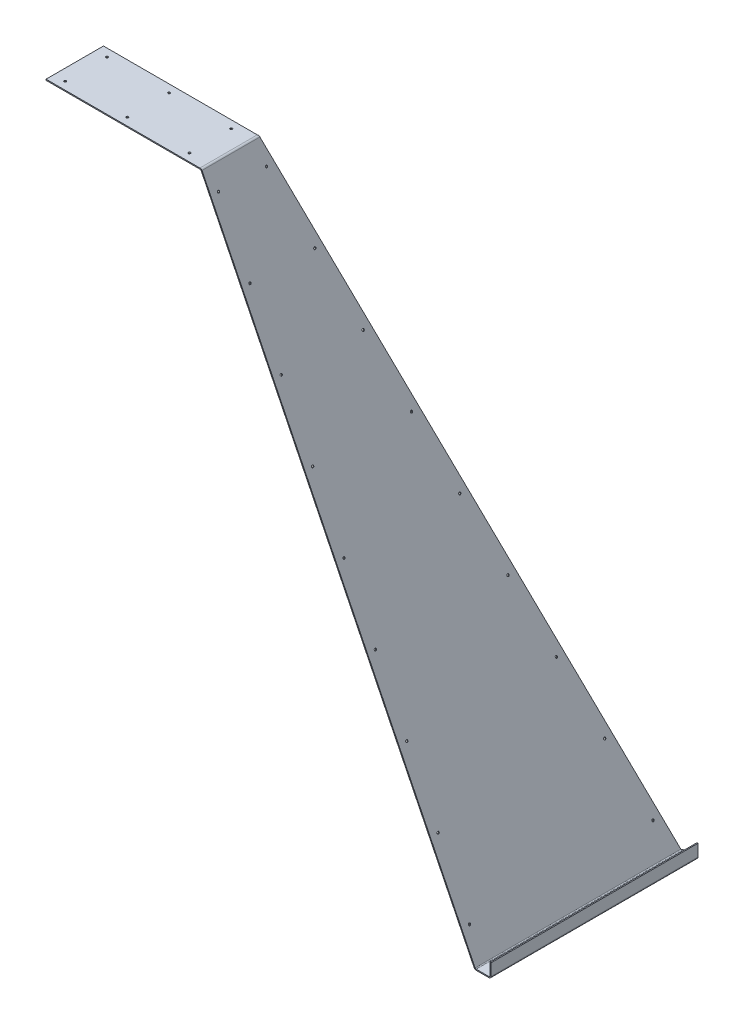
ISO-10303-21;
HEADER;
FILE_DESCRIPTION(('STEP AP214'),'2;1');
FILE_NAME('part.step','',(''),(''),'','','');
FILE_SCHEMA(('AUTOMOTIVE_DESIGN { 1 0 10303 214 1 1 1 1 }'));
ENDSEC;
DATA;
#1=APPLICATION_CONTEXT('core data for automotive mechanical design processes');
#2=APPLICATION_PROTOCOL_DEFINITION('international standard','automotive_design',2000,#1);
#3=PRODUCT_CONTEXT('',#1,'mechanical');
#4=PRODUCT('Part','Part','',(#3));
#5=PRODUCT_RELATED_PRODUCT_CATEGORY('part','',(#4));
#6=PRODUCT_DEFINITION_FORMATION('','',#4);
#7=PRODUCT_DEFINITION_CONTEXT('part definition',#1,'design');
#8=PRODUCT_DEFINITION('design','',#6,#7);
#9=PRODUCT_DEFINITION_SHAPE('','',#8);
#10=(LENGTH_UNIT() NAMED_UNIT(*) SI_UNIT(.MILLI.,.METRE.));
#11=(NAMED_UNIT(*) PLANE_ANGLE_UNIT() SI_UNIT($,.RADIAN.));
#12=(NAMED_UNIT(*) SI_UNIT($,.STERADIAN.) SOLID_ANGLE_UNIT());
#13=UNCERTAINTY_MEASURE_WITH_UNIT(LENGTH_MEASURE(1.E-05),#10,'distance_accuracy_value','');
#14=(GEOMETRIC_REPRESENTATION_CONTEXT(3) GLOBAL_UNCERTAINTY_ASSIGNED_CONTEXT((#13)) GLOBAL_UNIT_ASSIGNED_CONTEXT((#10,
#11,#12)) REPRESENTATION_CONTEXT('',''));
#15=CARTESIAN_POINT('',(0.,0.,0.));
#16=DIRECTION('',(0.,0.,1.));
#17=DIRECTION('',(1.,0.,0.));
#18=AXIS2_PLACEMENT_3D('',#15,#16,#17);
#19=CARTESIAN_POINT('',(-30.,-2.,200.));
#20=DIRECTION('',(0.,1.,0.));
#21=DIRECTION('',(0.,0.,1.));
#22=AXIS2_PLACEMENT_3D('',#19,#20,#21);
#23=PLANE('',#22);
#24=DIRECTION('',(0.,0.,-1.));
#25=VECTOR('',#24,1.);
#26=CARTESIAN_POINT('',(-3.99999999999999,-1.99999999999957,-200.));
#27=LINE('',#26,#25);
#28=CARTESIAN_POINT('',(-3.99999999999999,-1.99999999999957,-200.));
#29=VERTEX_POINT('',#28);
#30=CARTESIAN_POINT('',(-3.99999999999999,-2.,200.));
#31=VERTEX_POINT('',#30);
#32=EDGE_CURVE('E225',#29,#31,#27,.F.);
#33=ORIENTED_EDGE('',*,*,#32,.T.);
#34=DIRECTION('',(1.,0.,0.));
#35=VECTOR('',#34,1.);
#36=CARTESIAN_POINT('',(-28.6793571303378,-2.,200.));
#37=LINE('',#36,#35);
#38=CARTESIAN_POINT('',(-28.6793571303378,-2.,200.));
#39=VERTEX_POINT('',#38);
#40=EDGE_CURVE('E283',#39,#31,#37,.T.);
#41=ORIENTED_EDGE('',*,*,#40,.F.);
#42=DIRECTION('',(0.,0.,-1.));
#43=VECTOR('',#42,1.);
#44=CARTESIAN_POINT('',(-28.6793571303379,-2.,200.));
#45=LINE('',#44,#43);
#46=CARTESIAN_POINT('',(-28.6793571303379,-2.,-200.));
#47=VERTEX_POINT('',#46);
#48=EDGE_CURVE('E314',#39,#47,#45,.T.);
#49=ORIENTED_EDGE('',*,*,#48,.T.);
#50=DIRECTION('',(1.,0.,0.));
#51=VECTOR('',#50,1.);
#52=CARTESIAN_POINT('',(-30.,-2.,-200.));
#53=LINE('',#52,#51);
#54=EDGE_CURVE('E310',#47,#29,#53,.T.);
#55=ORIENTED_EDGE('',*,*,#54,.T.);
#56=EDGE_LOOP('',(#33,#41,#49,#55));
#57=FACE_BOUND('',#56,.T.);
#58=ADVANCED_FACE('F60',(#57),#23,.F.);
#59=CARTESIAN_POINT('',(-30.,0.,200.));
#60=DIRECTION('',(0.,1.,0.));
#61=DIRECTION('',(0.,0.,1.));
#62=AXIS2_PLACEMENT_3D('',#59,#60,#61);
#63=PLANE('',#62);
#64=DIRECTION('',(1.,0.,0.));
#65=VECTOR('',#64,1.);
#66=CARTESIAN_POINT('',(-30.,0.,200.));
#67=LINE('',#66,#65);
#68=CARTESIAN_POINT('',(-28.6793571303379,0.,200.));
#69=VERTEX_POINT('',#68);
#70=CARTESIAN_POINT('',(-3.99999999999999,0.,200.));
#71=VERTEX_POINT('',#70);
#72=EDGE_CURVE('E285',#69,#71,#67,.T.);
#73=ORIENTED_EDGE('',*,*,#72,.T.);
#74=DIRECTION('',(0.,0.,-1.));
#75=VECTOR('',#74,1.);
#76=CARTESIAN_POINT('',(-3.99999999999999,4.28043017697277E-13,-200.));
#77=LINE('',#76,#75);
#78=CARTESIAN_POINT('',(-3.99999999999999,0.,-200.));
#79=VERTEX_POINT('',#78);
#80=EDGE_CURVE('E75',#79,#71,#77,.F.);
#81=ORIENTED_EDGE('',*,*,#80,.F.);
#82=DIRECTION('',(1.,0.,0.));
#83=VECTOR('',#82,1.);
#84=CARTESIAN_POINT('',(-30.,0.,-200.));
#85=LINE('',#84,#83);
#86=CARTESIAN_POINT('',(-28.6793571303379,0.,-200.));
#87=VERTEX_POINT('',#86);
#88=EDGE_CURVE('E312',#87,#79,#85,.T.);
#89=ORIENTED_EDGE('',*,*,#88,.F.);
#90=DIRECTION('',(0.,0.,-1.));
#91=VECTOR('',#90,1.);
#92=CARTESIAN_POINT('',(-28.6793571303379,0.,200.));
#93=LINE('',#92,#91);
#94=EDGE_CURVE('E341',#69,#87,#93,.T.);
#95=ORIENTED_EDGE('',*,*,#94,.F.);
#96=EDGE_LOOP('',(#73,#81,#89,#95));
#97=FACE_BOUND('',#96,.T.);
#98=ADVANCED_FACE('F379',(#97),#63,.T.);
#99=CARTESIAN_POINT('',(-28.6793571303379,2.,-200.));
#100=DIRECTION('',(0.,0.,-1.));
#101=DIRECTION('',(-1.,0.,0.));
#102=AXIS2_PLACEMENT_3D('',#99,#100,#101);
#103=PLANE('',#102);
#104=ORIENTED_EDGE('',*,*,#88,.T.);
#105=DIRECTION('',(0.,-1.,0.));
#106=VECTOR('',#105,1.);
#107=CARTESIAN_POINT('',(-3.99999999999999,4.28043017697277E-13,-200.));
#108=LINE('',#107,#106);
#109=EDGE_CURVE('E231',#79,#29,#108,.T.);
#110=ORIENTED_EDGE('',*,*,#109,.T.);
#111=ORIENTED_EDGE('',*,*,#54,.F.);
#112=DIRECTION('',(0.,1.,0.));
#113=VECTOR('',#112,1.);
#114=CARTESIAN_POINT('',(-28.6793571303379,-2.,-200.));
#115=LINE('',#114,#113);
#116=EDGE_CURVE('E344',#47,#87,#115,.T.);
#117=ORIENTED_EDGE('',*,*,#116,.T.);
#118=EDGE_LOOP('',(#104,#110,#111,#117));
#119=FACE_BOUND('',#118,.T.);
#120=ADVANCED_FACE('F386',(#119),#103,.T.);
#121=CARTESIAN_POINT('',(-28.6793571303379,2.,200.));
#122=DIRECTION('',(0.,0.,-1.));
#123=DIRECTION('',(-1.,0.,0.));
#124=AXIS2_PLACEMENT_3D('',#121,#122,#123);
#125=CYLINDRICAL_SURFACE('',#124,2.);
#126=ORIENTED_EDGE('',*,*,#94,.T.);
#127=CARTESIAN_POINT('',(-28.6793571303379,2.,-200.));
#128=DIRECTION('',(0.813917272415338,0.,0.580980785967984));
#129=DIRECTION('',(0.580980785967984,0.,-0.813917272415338));
#130=AXIS2_PLACEMENT_3D('',#127,#128,#129);
#131=ELLIPSE('',#130,3.44245463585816,2.);
#132=CARTESIAN_POINT('',(-30.5186613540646,1.21453200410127,-197.423251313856));
#133=VERTEX_POINT('',#132);
#134=EDGE_CURVE('E239',#87,#133,#131,.F.);
#135=ORIENTED_EDGE('',*,*,#134,.T.);
#136=DIRECTION('',(0.,0.,-1.));
#137=VECTOR('',#136,1.);
#138=CARTESIAN_POINT('',(-30.5186613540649,1.21453200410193,200.));
#139=LINE('',#138,#137);
#140=CARTESIAN_POINT('',(-30.5186613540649,1.21453200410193,200.190025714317));
#141=VERTEX_POINT('',#140);
#142=EDGE_CURVE('E338',#141,#133,#139,.T.);
#143=ORIENTED_EDGE('',*,*,#142,.F.);
#144=CARTESIAN_POINT('',(-28.6793571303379,2.,200.));
#145=DIRECTION('',(-0.102766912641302,0.,-0.994705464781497));
#146=DIRECTION('',(0.994705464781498,0.,-0.102766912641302));
#147=AXIS2_PLACEMENT_3D('',#144,#145,#146);
#148=ELLIPSE('',#147,2.01064543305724,2.);
#149=EDGE_CURVE('E277',#141,#69,#148,.F.);
#150=ORIENTED_EDGE('',*,*,#149,.T.);
#151=EDGE_LOOP('',(#126,#135,#143,#150));
#152=FACE_BOUND('',#151,.T.);
#153=ADVANCED_FACE('F429',(#152),#125,.F.);
#154=CARTESIAN_POINT('',(-509.999999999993,1123.99999999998,200.));
#155=DIRECTION('',(0.919652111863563,0.392733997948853,0.));
#156=DIRECTION('',(-0.392733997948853,0.919652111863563,0.));
#157=AXIS2_PLACEMENT_3D('',#154,#155,#156);
#158=PLANE('',#157);
#159=CARTESIAN_POINT('',(-52.9999902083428,53.8583104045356,-166.118552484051));
#160=DIRECTION('',(0.919652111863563,0.392733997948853,0.));
#161=DIRECTION('',(-0.392733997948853,0.919652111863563,0.));
#162=AXIS2_PLACEMENT_3D('',#159,#160,#161);
#163=CIRCLE('',#162,2.10000000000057);
#164=CARTESIAN_POINT('',(-53.8247316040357,55.7895798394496,-166.118552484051));
#165=VERTEX_POINT('',#164);
#166=EDGE_CURVE('E614',#165,#165,#163,.T.);
#167=ORIENTED_EDGE('',*,*,#166,.F.);
#168=EDGE_LOOP('',(#167));
#169=FACE_BOUND('',#168,.T.);
#170=CARTESIAN_POINT('',(-107.906672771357,182.431458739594,-127.658160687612));
#171=DIRECTION('',(0.919652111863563,0.392733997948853,0.));
#172=DIRECTION('',(-0.392733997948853,0.919652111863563,0.));
#173=AXIS2_PLACEMENT_3D('',#170,#171,#172);
#174=CIRCLE('',#173,2.10000000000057);
#175=CARTESIAN_POINT('',(-108.73141416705,184.362728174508,-127.658160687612));
#176=VERTEX_POINT('',#175);
#177=EDGE_CURVE('E620',#176,#176,#174,.T.);
#178=ORIENTED_EDGE('',*,*,#177,.F.);
#179=EDGE_LOOP('',(#178));
#180=FACE_BOUND('',#179,.T.);
#181=CARTESIAN_POINT('',(-162.813355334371,311.004607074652,-89.1977688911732));
#182=DIRECTION('',(0.919652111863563,0.392733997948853,0.));
#183=DIRECTION('',(-0.392733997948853,0.919652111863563,0.));
#184=AXIS2_PLACEMENT_3D('',#181,#182,#183);
#185=CIRCLE('',#184,2.10000000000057);
#186=CARTESIAN_POINT('',(-163.638096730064,312.935876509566,-89.1977688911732));
#187=VERTEX_POINT('',#186);
#188=EDGE_CURVE('E626',#187,#187,#185,.T.);
#189=ORIENTED_EDGE('',*,*,#188,.F.);
#190=EDGE_LOOP('',(#189));
#191=FACE_BOUND('',#190,.T.);
#192=CARTESIAN_POINT('',(-217.720037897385,439.577755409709,-50.7373770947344));
#193=DIRECTION('',(0.919652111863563,0.392733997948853,0.));
#194=DIRECTION('',(-0.392733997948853,0.919652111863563,0.));
#195=AXIS2_PLACEMENT_3D('',#192,#193,#194);
#196=CIRCLE('',#195,2.10000000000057);
#197=CARTESIAN_POINT('',(-218.544779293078,441.509024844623,-50.7373770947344));
#198=VERTEX_POINT('',#197);
#199=EDGE_CURVE('E632',#198,#198,#196,.T.);
#200=ORIENTED_EDGE('',*,*,#199,.F.);
#201=EDGE_LOOP('',(#200));
#202=FACE_BOUND('',#201,.T.);
#203=CARTESIAN_POINT('',(-272.626720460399,568.150903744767,-12.2769852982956));
#204=DIRECTION('',(0.919652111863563,0.392733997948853,0.));
#205=DIRECTION('',(-0.392733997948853,0.919652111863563,0.));
#206=AXIS2_PLACEMENT_3D('',#203,#204,#205);
#207=CIRCLE('',#206,2.10000000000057);
#208=CARTESIAN_POINT('',(-273.451461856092,570.082173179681,-12.2769852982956));
#209=VERTEX_POINT('',#208);
#210=EDGE_CURVE('E638',#209,#209,#207,.T.);
#211=ORIENTED_EDGE('',*,*,#210,.F.);
#212=EDGE_LOOP('',(#211));
#213=FACE_BOUND('',#212,.T.);
#214=CARTESIAN_POINT('',(-327.533403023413,696.724052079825,26.1834064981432));
#215=DIRECTION('',(0.919652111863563,0.392733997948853,0.));
#216=DIRECTION('',(-0.392733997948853,0.919652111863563,0.));
#217=AXIS2_PLACEMENT_3D('',#214,#215,#216);
#218=CIRCLE('',#217,2.10000000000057);
#219=CARTESIAN_POINT('',(-328.358144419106,698.655321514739,26.1834064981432));
#220=VERTEX_POINT('',#219);
#221=EDGE_CURVE('E644',#220,#220,#218,.T.);
#222=ORIENTED_EDGE('',*,*,#221,.F.);
#223=EDGE_LOOP('',(#222));
#224=FACE_BOUND('',#223,.T.);
#225=CARTESIAN_POINT('',(-382.440085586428,825.297200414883,64.643798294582));
#226=DIRECTION('',(0.919652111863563,0.392733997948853,0.));
#227=DIRECTION('',(-0.392733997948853,0.919652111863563,0.));
#228=AXIS2_PLACEMENT_3D('',#225,#226,#227);
#229=CIRCLE('',#228,2.10000000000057);
#230=CARTESIAN_POINT('',(-383.26482698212,827.228469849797,64.643798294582));
#231=VERTEX_POINT('',#230);
#232=EDGE_CURVE('E650',#231,#231,#229,.T.);
#233=ORIENTED_EDGE('',*,*,#232,.F.);
#234=EDGE_LOOP('',(#233));
#235=FACE_BOUND('',#234,.T.);
#236=CARTESIAN_POINT('',(-437.346768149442,953.870348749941,103.104190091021));
#237=DIRECTION('',(0.919652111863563,0.392733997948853,0.));
#238=DIRECTION('',(-0.392733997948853,0.919652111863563,0.));
#239=AXIS2_PLACEMENT_3D('',#236,#237,#238);
#240=CIRCLE('',#239,2.10000000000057);
#241=CARTESIAN_POINT('',(-438.171509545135,955.801618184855,103.104190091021));
#242=VERTEX_POINT('',#241);
#243=EDGE_CURVE('E656',#242,#242,#240,.T.);
#244=ORIENTED_EDGE('',*,*,#243,.F.);
#245=EDGE_LOOP('',(#244));
#246=FACE_BOUND('',#245,.T.);
#247=CARTESIAN_POINT('',(-492.253450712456,1082.443497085,141.56458188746));
#248=DIRECTION('',(0.919652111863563,0.392733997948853,0.));
#249=DIRECTION('',(-0.392733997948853,0.919652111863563,0.));
#250=AXIS2_PLACEMENT_3D('',#247,#248,#249);
#251=CIRCLE('',#250,2.10000000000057);
#252=CARTESIAN_POINT('',(-493.078192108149,1084.37476651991,141.56458188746));
#253=VERTEX_POINT('',#252);
#254=EDGE_CURVE('E662',#253,#253,#251,.T.);
#255=ORIENTED_EDGE('',*,*,#254,.F.);
#256=EDGE_LOOP('',(#255));
#257=FACE_BOUND('',#256,.T.);
#258=CARTESIAN_POINT('',(-54.004616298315,56.2108098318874,187.604109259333));
#259=DIRECTION('',(0.919652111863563,0.392733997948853,0.));
#260=DIRECTION('',(-0.392733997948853,0.919652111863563,0.));
#261=AXIS2_PLACEMENT_3D('',#258,#259,#260);
#262=CIRCLE('',#261,2.10000000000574);
#263=CARTESIAN_POINT('',(-54.8293576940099,58.1420792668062,187.604109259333));
#264=VERTEX_POINT('',#263);
#265=EDGE_CURVE('E668',#264,#264,#262,.T.);
#266=ORIENTED_EDGE('',*,*,#265,.F.);
#267=EDGE_LOOP('',(#266));
#268=FACE_BOUND('',#267,.T.);
#269=CARTESIAN_POINT('',(-108.942172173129,184.856253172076,193.279923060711));
#270=DIRECTION('',(0.919652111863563,0.392733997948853,0.));
#271=DIRECTION('',(-0.392733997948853,0.919652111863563,0.));
#272=AXIS2_PLACEMENT_3D('',#269,#270,#271);
#273=CIRCLE('',#272,2.10000000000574);
#274=CARTESIAN_POINT('',(-109.766913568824,186.787522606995,193.279923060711));
#275=VERTEX_POINT('',#274);
#276=EDGE_CURVE('E674',#275,#275,#273,.T.);
#277=ORIENTED_EDGE('',*,*,#276,.F.);
#278=EDGE_LOOP('',(#277));
#279=FACE_BOUND('',#278,.T.);
#280=CARTESIAN_POINT('',(-163.879728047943,313.501696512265,198.95573686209));
#281=DIRECTION('',(0.919652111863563,0.392733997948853,0.));
#282=DIRECTION('',(-0.392733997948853,0.919652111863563,0.));
#283=AXIS2_PLACEMENT_3D('',#280,#281,#282);
#284=CIRCLE('',#283,2.10000000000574);
#285=CARTESIAN_POINT('',(-164.704469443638,315.432965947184,198.95573686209));
#286=VERTEX_POINT('',#285);
#287=EDGE_CURVE('E680',#286,#286,#284,.T.);
#288=ORIENTED_EDGE('',*,*,#287,.F.);
#289=EDGE_LOOP('',(#288));
#290=FACE_BOUND('',#289,.T.);
#291=CARTESIAN_POINT('',(-218.817283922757,442.147139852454,204.631550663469));
#292=DIRECTION('',(0.919652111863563,0.392733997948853,0.));
#293=DIRECTION('',(-0.392733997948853,0.919652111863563,0.));
#294=AXIS2_PLACEMENT_3D('',#291,#292,#293);
#295=CIRCLE('',#294,2.10000000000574);
#296=CARTESIAN_POINT('',(-219.642025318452,444.078409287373,204.631550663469));
#297=VERTEX_POINT('',#296);
#298=EDGE_CURVE('E686',#297,#297,#295,.T.);
#299=ORIENTED_EDGE('',*,*,#298,.F.);
#300=EDGE_LOOP('',(#299));
#301=FACE_BOUND('',#300,.T.);
#302=CARTESIAN_POINT('',(-273.754839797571,570.792583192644,210.307364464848));
#303=DIRECTION('',(0.919652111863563,0.392733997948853,0.));
#304=DIRECTION('',(-0.392733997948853,0.919652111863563,0.));
#305=AXIS2_PLACEMENT_3D('',#302,#303,#304);
#306=CIRCLE('',#305,2.10000000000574);
#307=CARTESIAN_POINT('',(-274.579581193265,572.723852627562,210.307364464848));
#308=VERTEX_POINT('',#307);
#309=EDGE_CURVE('E692',#308,#308,#306,.T.);
#310=ORIENTED_EDGE('',*,*,#309,.F.);
#311=EDGE_LOOP('',(#310));
#312=FACE_BOUND('',#311,.T.);
#313=CARTESIAN_POINT('',(-328.692395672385,699.438026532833,215.983178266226));
#314=DIRECTION('',(0.919652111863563,0.392733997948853,0.));
#315=DIRECTION('',(-0.392733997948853,0.919652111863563,0.));
#316=AXIS2_PLACEMENT_3D('',#313,#314,#315);
#317=CIRCLE('',#316,2.10000000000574);
#318=CARTESIAN_POINT('',(-329.517137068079,701.369295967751,215.983178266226));
#319=VERTEX_POINT('',#318);
#320=EDGE_CURVE('E698',#319,#319,#317,.T.);
#321=ORIENTED_EDGE('',*,*,#320,.F.);
#322=EDGE_LOOP('',(#321));
#323=FACE_BOUND('',#322,.T.);
#324=CARTESIAN_POINT('',(-383.629951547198,828.083469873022,221.658992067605));
#325=DIRECTION('',(0.919652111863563,0.392733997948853,0.));
#326=DIRECTION('',(-0.392733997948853,0.919652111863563,0.));
#327=AXIS2_PLACEMENT_3D('',#324,#325,#326);
#328=CIRCLE('',#327,2.10000000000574);
#329=CARTESIAN_POINT('',(-384.454692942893,830.01473930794,221.658992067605));
#330=VERTEX_POINT('',#329);
#331=EDGE_CURVE('E704',#330,#330,#328,.T.);
#332=ORIENTED_EDGE('',*,*,#331,.F.);
#333=EDGE_LOOP('',(#332));
#334=FACE_BOUND('',#333,.T.);
#335=CARTESIAN_POINT('',(-438.567507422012,956.728913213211,227.334805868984));
#336=DIRECTION('',(0.919652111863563,0.392733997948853,0.));
#337=DIRECTION('',(-0.392733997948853,0.919652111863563,0.));
#338=AXIS2_PLACEMENT_3D('',#335,#336,#337);
#339=CIRCLE('',#338,2.10000000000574);
#340=CARTESIAN_POINT('',(-439.392248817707,958.660182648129,227.334805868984));
#341=VERTEX_POINT('',#340);
#342=EDGE_CURVE('E710',#341,#341,#339,.T.);
#343=ORIENTED_EDGE('',*,*,#342,.F.);
#344=EDGE_LOOP('',(#343));
#345=FACE_BOUND('',#344,.T.);
#346=CARTESIAN_POINT('',(-493.505063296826,1085.3743565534,233.010619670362));
#347=DIRECTION('',(0.919652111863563,0.392733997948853,0.));
#348=DIRECTION('',(-0.392733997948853,0.919652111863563,0.));
#349=AXIS2_PLACEMENT_3D('',#346,#347,#348);
#350=CIRCLE('',#349,2.10000000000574);
#351=CARTESIAN_POINT('',(-494.329804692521,1087.30562598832,233.010619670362));
#352=VERTEX_POINT('',#351);
#353=EDGE_CURVE('E716',#352,#352,#350,.T.);
#354=ORIENTED_EDGE('',*,*,#353,.F.);
#355=EDGE_LOOP('',(#354));
#356=FACE_BOUND('',#355,.T.);
#357=ORIENTED_EDGE('',*,*,#142,.T.);
#358=DIRECTION('',(-0.378666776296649,0.886711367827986,0.265244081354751));
#359=VECTOR('',#358,1.);
#360=CARTESIAN_POINT('',(-132.359897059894,239.692758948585,-126.086691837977));
#361=LINE('',#360,#359);
#362=CARTESIAN_POINT('',(-508.962677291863,1121.57093599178,137.711625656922));
#363=VERTEX_POINT('',#362);
#364=EDGE_CURVE('E260',#133,#363,#361,.T.);
#365=ORIENTED_EDGE('',*,*,#364,.T.);
#366=DIRECTION('',(0.,0.,-1.));
#367=VECTOR('',#366,1.);
#368=CARTESIAN_POINT('',(-508.962677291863,1121.57093599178,200.));
#369=LINE('',#368,#367);
#370=CARTESIAN_POINT('',(-508.962677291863,1121.57093599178,249.619948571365));
#371=VERTEX_POINT('',#370);
#372=EDGE_CURVE('E335',#371,#363,#369,.T.);
#373=ORIENTED_EDGE('',*,*,#372,.F.);
#374=DIRECTION('',(0.392411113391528,-0.918896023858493,-0.040541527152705));
#375=VECTOR('',#374,1.);
#376=CARTESIAN_POINT('',(-104.391979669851,174.201219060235,207.82216720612));
#377=LINE('',#376,#375);
#378=EDGE_CURVE('E290',#371,#141,#377,.T.);
#379=ORIENTED_EDGE('',*,*,#378,.T.);
#380=EDGE_LOOP('',(#357,#365,#373,#379));
#381=FACE_BOUND('',#380,.T.);
#382=ADVANCED_FACE('F767',(#169,#180,#191,#202,#213,#224,#235,#246,#257,#268,#279,#290,#301,
#312,#323,#334,#345,#356,#381),#158,.T.);
#383=CARTESIAN_POINT('',(-512.641285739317,1119.99999999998,200.));
#384=DIRECTION('',(0.,0.,-1.));
#385=DIRECTION('',(-1.,0.,0.));
#386=AXIS2_PLACEMENT_3D('',#383,#384,#385);
#387=CYLINDRICAL_SURFACE('',#386,4.);
#388=ORIENTED_EDGE('',*,*,#372,.T.);
#389=CARTESIAN_POINT('',(-512.641285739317,1119.99999999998,138.999999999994));
#390=DIRECTION('',(0.330547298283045,0.,0.943789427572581));
#391=DIRECTION('',(0.943789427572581,0.,-0.330547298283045));
#392=AXIS2_PLACEMENT_3D('',#389,#390,#391);
#393=ELLIPSE('',#392,4.23823353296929,4.);
#394=CARTESIAN_POINT('',(-512.641285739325,1123.99999999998,139.));
#395=VERTEX_POINT('',#394);
#396=EDGE_CURVE('E245',#363,#395,#393,.T.);
#397=ORIENTED_EDGE('',*,*,#396,.T.);
#398=DIRECTION('',(0.,0.,-1.));
#399=VECTOR('',#398,1.);
#400=CARTESIAN_POINT('',(-512.641285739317,1123.99999999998,200.));
#401=LINE('',#400,#399);
#402=CARTESIAN_POINT('',(-512.641285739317,1123.99999999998,250.));
#403=VERTEX_POINT('',#402);
#404=EDGE_CURVE('E332',#403,#395,#401,.T.);
#405=ORIENTED_EDGE('',*,*,#404,.F.);
#406=CARTESIAN_POINT('',(-512.641285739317,1119.99999999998,250.));
#407=DIRECTION('',(-0.102766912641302,0.,-0.994705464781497));
#408=DIRECTION('',(0.994705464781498,0.,-0.102766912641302));
#409=AXIS2_PLACEMENT_3D('',#406,#407,#408);
#410=ELLIPSE('',#409,4.02129086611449,4.);
#411=EDGE_CURVE('E267',#403,#371,#410,.T.);
#412=ORIENTED_EDGE('',*,*,#411,.T.);
#413=EDGE_LOOP('',(#388,#397,#405,#412));
#414=FACE_BOUND('',#413,.T.);
#415=ADVANCED_FACE('F423',(#414),#387,.T.);
#416=CARTESIAN_POINT('',(-512.641285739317,1119.99999999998,200.));
#417=DIRECTION('',(0.,0.,-1.));
#418=DIRECTION('',(-1.,0.,0.));
#419=AXIS2_PLACEMENT_3D('',#416,#417,#418);
#420=CYLINDRICAL_SURFACE('',#419,2.);
#421=CARTESIAN_POINT('',(-512.641285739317,1119.99999999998,138.999999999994));
#422=DIRECTION('',(0.573719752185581,0.,0.819051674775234));
#423=DIRECTION('',(0.819051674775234,0.,-0.573719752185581));
#424=AXIS2_PLACEMENT_3D('',#421,#422,#423);
#425=ELLIPSE('',#424,2.44184837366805,2.);
#426=CARTESIAN_POINT('',(-510.80198151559,1120.78546799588,137.711625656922));
#427=VERTEX_POINT('',#426);
#428=CARTESIAN_POINT('',(-512.641285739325,1121.99999999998,139.));
#429=VERTEX_POINT('',#428);
#430=EDGE_CURVE('E242',#427,#429,#425,.T.);
#431=ORIENTED_EDGE('',*,*,#430,.F.);
#432=DIRECTION('',(0.,0.,-1.));
#433=VECTOR('',#432,1.);
#434=CARTESIAN_POINT('',(-510.80198151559,1120.78546799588,200.));
#435=LINE('',#434,#433);
#436=CARTESIAN_POINT('',(-510.80198151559,1120.78546799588,249.619948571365));
#437=VERTEX_POINT('',#436);
#438=EDGE_CURVE('E320',#437,#427,#435,.T.);
#439=ORIENTED_EDGE('',*,*,#438,.F.);
#440=CARTESIAN_POINT('',(-512.641285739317,1119.99999999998,250.));
#441=DIRECTION('',(-0.202353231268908,0.,-0.979312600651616));
#442=DIRECTION('',(0.979312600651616,0.,-0.202353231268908));
#443=AXIS2_PLACEMENT_3D('',#440,#441,#442);
#444=ELLIPSE('',#443,2.04224881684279,2.);
#445=CARTESIAN_POINT('',(-512.641285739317,1121.99999999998,250.));
#446=VERTEX_POINT('',#445);
#447=EDGE_CURVE('E272',#446,#437,#444,.T.);
#448=ORIENTED_EDGE('',*,*,#447,.F.);
#449=DIRECTION('',(0.,0.,-1.));
#450=VECTOR('',#449,1.);
#451=CARTESIAN_POINT('',(-512.641285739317,1121.99999999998,200.));
#452=LINE('',#451,#450);
#453=EDGE_CURVE('E323',#446,#429,#452,.T.);
#454=ORIENTED_EDGE('',*,*,#453,.T.);
#455=EDGE_LOOP('',(#431,#439,#448,#454));
#456=FACE_BOUND('',#455,.T.);
#457=ADVANCED_FACE('F420',(#456),#420,.F.);
#458=CARTESIAN_POINT('',(-511.83930422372,1123.21453200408,200.));
#459=DIRECTION('',(0.919652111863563,0.392733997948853,0.));
#460=DIRECTION('',(-0.392733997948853,0.919652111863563,0.));
#461=AXIS2_PLACEMENT_3D('',#458,#459,#460);
#462=PLANE('',#461);
#463=CARTESIAN_POINT('',(-54.8392944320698,53.072842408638,-166.118552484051));
#464=DIRECTION('',(0.919652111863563,0.392733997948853,0.));
#465=DIRECTION('',(-0.392733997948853,0.919652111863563,0.));
#466=AXIS2_PLACEMENT_3D('',#463,#464,#465);
#467=CIRCLE('',#466,2.10000000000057);
#468=CARTESIAN_POINT('',(-55.6640358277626,55.004111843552,-166.118552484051));
#469=VERTEX_POINT('',#468);
#470=EDGE_CURVE('E617',#469,#469,#467,.F.);
#471=ORIENTED_EDGE('',*,*,#470,.F.);
#472=EDGE_LOOP('',(#471));
#473=FACE_BOUND('',#472,.T.);
#474=CARTESIAN_POINT('',(-109.745976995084,181.645990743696,-127.658160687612));
#475=DIRECTION('',(0.919652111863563,0.392733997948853,0.));
#476=DIRECTION('',(-0.392733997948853,0.919652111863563,0.));
#477=AXIS2_PLACEMENT_3D('',#474,#475,#476);
#478=CIRCLE('',#477,2.10000000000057);
#479=CARTESIAN_POINT('',(-110.570718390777,183.57726017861,-127.658160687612));
#480=VERTEX_POINT('',#479);
#481=EDGE_CURVE('E623',#480,#480,#478,.F.);
#482=ORIENTED_EDGE('',*,*,#481,.F.);
#483=EDGE_LOOP('',(#482));
#484=FACE_BOUND('',#483,.T.);
#485=CARTESIAN_POINT('',(-164.652659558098,310.219139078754,-89.1977688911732));
#486=DIRECTION('',(0.919652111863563,0.392733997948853,0.));
#487=DIRECTION('',(-0.392733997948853,0.919652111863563,0.));
#488=AXIS2_PLACEMENT_3D('',#485,#486,#487);
#489=CIRCLE('',#488,2.10000000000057);
#490=CARTESIAN_POINT('',(-165.477400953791,312.150408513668,-89.1977688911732));
#491=VERTEX_POINT('',#490);
#492=EDGE_CURVE('E629',#491,#491,#489,.F.);
#493=ORIENTED_EDGE('',*,*,#492,.F.);
#494=EDGE_LOOP('',(#493));
#495=FACE_BOUND('',#494,.T.);
#496=CARTESIAN_POINT('',(-219.559342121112,438.792287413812,-50.7373770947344));
#497=DIRECTION('',(0.919652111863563,0.392733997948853,0.));
#498=DIRECTION('',(-0.392733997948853,0.919652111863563,0.));
#499=AXIS2_PLACEMENT_3D('',#496,#497,#498);
#500=CIRCLE('',#499,2.10000000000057);
#501=CARTESIAN_POINT('',(-220.384083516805,440.723556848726,-50.7373770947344));
#502=VERTEX_POINT('',#501);
#503=EDGE_CURVE('E635',#502,#502,#500,.F.);
#504=ORIENTED_EDGE('',*,*,#503,.F.);
#505=EDGE_LOOP('',(#504));
#506=FACE_BOUND('',#505,.T.);
#507=CARTESIAN_POINT('',(-274.466024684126,567.36543574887,-12.2769852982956));
#508=DIRECTION('',(0.919652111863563,0.392733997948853,0.));
#509=DIRECTION('',(-0.392733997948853,0.919652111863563,0.));
#510=AXIS2_PLACEMENT_3D('',#507,#508,#509);
#511=CIRCLE('',#510,2.10000000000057);
#512=CARTESIAN_POINT('',(-275.290766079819,569.296705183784,-12.2769852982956));
#513=VERTEX_POINT('',#512);
#514=EDGE_CURVE('E641',#513,#513,#511,.F.);
#515=ORIENTED_EDGE('',*,*,#514,.F.);
#516=EDGE_LOOP('',(#515));
#517=FACE_BOUND('',#516,.T.);
#518=CARTESIAN_POINT('',(-329.372707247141,695.938584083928,26.1834064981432));
#519=DIRECTION('',(0.919652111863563,0.392733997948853,0.));
#520=DIRECTION('',(-0.392733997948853,0.919652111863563,0.));
#521=AXIS2_PLACEMENT_3D('',#518,#519,#520);
#522=CIRCLE('',#521,2.10000000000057);
#523=CARTESIAN_POINT('',(-330.197448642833,697.869853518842,26.1834064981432));
#524=VERTEX_POINT('',#523);
#525=EDGE_CURVE('E647',#524,#524,#522,.F.);
#526=ORIENTED_EDGE('',*,*,#525,.F.);
#527=EDGE_LOOP('',(#526));
#528=FACE_BOUND('',#527,.T.);
#529=CARTESIAN_POINT('',(-384.279389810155,824.511732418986,64.643798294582));
#530=DIRECTION('',(0.919652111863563,0.392733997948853,0.));
#531=DIRECTION('',(-0.392733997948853,0.919652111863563,0.));
#532=AXIS2_PLACEMENT_3D('',#529,#530,#531);
#533=CIRCLE('',#532,2.10000000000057);
#534=CARTESIAN_POINT('',(-385.104131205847,826.4430018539,64.643798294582));
#535=VERTEX_POINT('',#534);
#536=EDGE_CURVE('E653',#535,#535,#533,.F.);
#537=ORIENTED_EDGE('',*,*,#536,.F.);
#538=EDGE_LOOP('',(#537));
#539=FACE_BOUND('',#538,.T.);
#540=CARTESIAN_POINT('',(-439.186072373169,953.084880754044,103.104190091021));
#541=DIRECTION('',(0.919652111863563,0.392733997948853,0.));
#542=DIRECTION('',(-0.392733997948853,0.919652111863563,0.));
#543=AXIS2_PLACEMENT_3D('',#540,#541,#542);
#544=CIRCLE('',#543,2.10000000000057);
#545=CARTESIAN_POINT('',(-440.010813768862,955.016150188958,103.104190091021));
#546=VERTEX_POINT('',#545);
#547=EDGE_CURVE('E659',#546,#546,#544,.F.);
#548=ORIENTED_EDGE('',*,*,#547,.F.);
#549=EDGE_LOOP('',(#548));
#550=FACE_BOUND('',#549,.T.);
#551=CARTESIAN_POINT('',(-494.092754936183,1081.6580290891,141.56458188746));
#552=DIRECTION('',(0.919652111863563,0.392733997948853,0.));
#553=DIRECTION('',(-0.392733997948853,0.919652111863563,0.));
#554=AXIS2_PLACEMENT_3D('',#551,#552,#553);
#555=CIRCLE('',#554,2.10000000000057);
#556=CARTESIAN_POINT('',(-494.917496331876,1083.58929852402,141.56458188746));
#557=VERTEX_POINT('',#556);
#558=EDGE_CURVE('E665',#557,#557,#555,.F.);
#559=ORIENTED_EDGE('',*,*,#558,.F.);
#560=EDGE_LOOP('',(#559));
#561=FACE_BOUND('',#560,.T.);
#562=CARTESIAN_POINT('',(-55.843920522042,55.4253418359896,187.604109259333));
#563=DIRECTION('',(0.919652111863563,0.392733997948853,0.));
#564=DIRECTION('',(-0.392733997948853,0.919652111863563,0.));
#565=AXIS2_PLACEMENT_3D('',#562,#563,#564);
#566=CIRCLE('',#565,2.10000000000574);
#567=CARTESIAN_POINT('',(-56.6686619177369,57.3566112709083,187.604109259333));
#568=VERTEX_POINT('',#567);
#569=EDGE_CURVE('E671',#568,#568,#566,.F.);
#570=ORIENTED_EDGE('',*,*,#569,.F.);
#571=EDGE_LOOP('',(#570));
#572=FACE_BOUND('',#571,.T.);
#573=CARTESIAN_POINT('',(-110.781476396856,184.070785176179,193.279923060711));
#574=DIRECTION('',(0.919652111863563,0.392733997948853,0.));
#575=DIRECTION('',(-0.392733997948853,0.919652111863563,0.));
#576=AXIS2_PLACEMENT_3D('',#573,#574,#575);
#577=CIRCLE('',#576,2.10000000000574);
#578=CARTESIAN_POINT('',(-111.606217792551,186.002054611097,193.279923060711));
#579=VERTEX_POINT('',#578);
#580=EDGE_CURVE('E677',#579,#579,#577,.F.);
#581=ORIENTED_EDGE('',*,*,#580,.F.);
#582=EDGE_LOOP('',(#581));
#583=FACE_BOUND('',#582,.T.);
#584=CARTESIAN_POINT('',(-165.71903227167,312.716228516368,198.95573686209));
#585=DIRECTION('',(0.919652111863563,0.392733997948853,0.));
#586=DIRECTION('',(-0.392733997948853,0.919652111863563,0.));
#587=AXIS2_PLACEMENT_3D('',#584,#585,#586);
#588=CIRCLE('',#587,2.10000000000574);
#589=CARTESIAN_POINT('',(-166.543773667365,314.647497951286,198.95573686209));
#590=VERTEX_POINT('',#589);
#591=EDGE_CURVE('E683',#590,#590,#588,.F.);
#592=ORIENTED_EDGE('',*,*,#591,.F.);
#593=EDGE_LOOP('',(#592));
#594=FACE_BOUND('',#593,.T.);
#595=CARTESIAN_POINT('',(-220.656588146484,441.361671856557,204.631550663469));
#596=DIRECTION('',(0.919652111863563,0.392733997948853,0.));
#597=DIRECTION('',(-0.392733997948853,0.919652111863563,0.));
#598=AXIS2_PLACEMENT_3D('',#595,#596,#597);
#599=CIRCLE('',#598,2.10000000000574);
#600=CARTESIAN_POINT('',(-221.481329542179,443.292941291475,204.631550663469));
#601=VERTEX_POINT('',#600);
#602=EDGE_CURVE('E689',#601,#601,#599,.F.);
#603=ORIENTED_EDGE('',*,*,#602,.F.);
#604=EDGE_LOOP('',(#603));
#605=FACE_BOUND('',#604,.T.);
#606=CARTESIAN_POINT('',(-275.594144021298,570.007115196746,210.307364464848));
#607=DIRECTION('',(0.919652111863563,0.392733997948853,0.));
#608=DIRECTION('',(-0.392733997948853,0.919652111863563,0.));
#609=AXIS2_PLACEMENT_3D('',#606,#607,#608);
#610=CIRCLE('',#609,2.10000000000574);
#611=CARTESIAN_POINT('',(-276.418885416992,571.938384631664,210.307364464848));
#612=VERTEX_POINT('',#611);
#613=EDGE_CURVE('E695',#612,#612,#610,.F.);
#614=ORIENTED_EDGE('',*,*,#613,.F.);
#615=EDGE_LOOP('',(#614));
#616=FACE_BOUND('',#615,.T.);
#617=CARTESIAN_POINT('',(-330.531699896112,698.652558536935,215.983178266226));
#618=DIRECTION('',(0.919652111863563,0.392733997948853,0.));
#619=DIRECTION('',(-0.392733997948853,0.919652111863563,0.));
#620=AXIS2_PLACEMENT_3D('',#617,#618,#619);
#621=CIRCLE('',#620,2.10000000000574);
#622=CARTESIAN_POINT('',(-331.356441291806,700.583827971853,215.983178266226));
#623=VERTEX_POINT('',#622);
#624=EDGE_CURVE('E701',#623,#623,#621,.F.);
#625=ORIENTED_EDGE('',*,*,#624,.F.);
#626=EDGE_LOOP('',(#625));
#627=FACE_BOUND('',#626,.T.);
#628=CARTESIAN_POINT('',(-385.469255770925,827.298001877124,221.658992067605));
#629=DIRECTION('',(0.919652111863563,0.392733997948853,0.));
#630=DIRECTION('',(-0.392733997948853,0.919652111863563,0.));
#631=AXIS2_PLACEMENT_3D('',#628,#629,#630);
#632=CIRCLE('',#631,2.10000000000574);
#633=CARTESIAN_POINT('',(-386.29399716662,829.229271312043,221.658992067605));
#634=VERTEX_POINT('',#633);
#635=EDGE_CURVE('E707',#634,#634,#632,.F.);
#636=ORIENTED_EDGE('',*,*,#635,.F.);
#637=EDGE_LOOP('',(#636));
#638=FACE_BOUND('',#637,.T.);
#639=CARTESIAN_POINT('',(-440.406811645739,955.943445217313,227.334805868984));
#640=DIRECTION('',(0.919652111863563,0.392733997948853,0.));
#641=DIRECTION('',(-0.392733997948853,0.919652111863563,0.));
#642=AXIS2_PLACEMENT_3D('',#639,#640,#641);
#643=CIRCLE('',#642,2.10000000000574);
#644=CARTESIAN_POINT('',(-441.231553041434,957.874714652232,227.334805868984));
#645=VERTEX_POINT('',#644);
#646=EDGE_CURVE('E713',#645,#645,#643,.F.);
#647=ORIENTED_EDGE('',*,*,#646,.F.);
#648=EDGE_LOOP('',(#647));
#649=FACE_BOUND('',#648,.T.);
#650=CARTESIAN_POINT('',(-495.344367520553,1084.5888885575,233.010619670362));
#651=DIRECTION('',(0.919652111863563,0.392733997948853,0.));
#652=DIRECTION('',(-0.392733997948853,0.919652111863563,0.));
#653=AXIS2_PLACEMENT_3D('',#650,#651,#652);
#654=CIRCLE('',#653,2.10000000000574);
#655=CARTESIAN_POINT('',(-496.169108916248,1086.52015799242,233.010619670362));
#656=VERTEX_POINT('',#655);
#657=EDGE_CURVE('E719',#656,#656,#654,.F.);
#658=ORIENTED_EDGE('',*,*,#657,.F.);
#659=EDGE_LOOP('',(#658));
#660=FACE_BOUND('',#659,.T.);
#661=DIRECTION('',(-0.378666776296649,0.886711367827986,0.265244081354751));
#662=VECTOR('',#661,1.);
#663=CARTESIAN_POINT('',(-134.199201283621,238.907290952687,-126.086691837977));
#664=LINE('',#663,#662);
#665=CARTESIAN_POINT('',(-32.3579655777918,0.429064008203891,-197.423251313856));
#666=VERTEX_POINT('',#665);
#667=EDGE_CURVE('E257',#666,#427,#664,.T.);
#668=ORIENTED_EDGE('',*,*,#667,.F.);
#669=DIRECTION('',(0.,0.,-1.));
#670=VECTOR('',#669,1.);
#671=CARTESIAN_POINT('',(-32.3579655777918,0.429064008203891,200.));
#672=LINE('',#671,#670);
#673=CARTESIAN_POINT('',(-32.3579655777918,0.429064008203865,200.190025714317));
#674=VERTEX_POINT('',#673);
#675=EDGE_CURVE('E317',#674,#666,#672,.T.);
#676=ORIENTED_EDGE('',*,*,#675,.F.);
#677=DIRECTION('',(0.392411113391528,-0.918896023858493,-0.040541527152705));
#678=VECTOR('',#677,1.);
#679=CARTESIAN_POINT('',(-106.231283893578,173.415751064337,207.82216720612));
#680=LINE('',#679,#678);
#681=EDGE_CURVE('E293',#437,#674,#680,.T.);
#682=ORIENTED_EDGE('',*,*,#681,.F.);
#683=ORIENTED_EDGE('',*,*,#438,.T.);
#684=EDGE_LOOP('',(#668,#676,#682,#683));
#685=FACE_BOUND('',#684,.T.);
#686=ADVANCED_FACE('F372',(#473,#484,#495,#506,#517,#528,#539,#550,#561,#572,#583,#594,#605,
#616,#627,#638,#649,#660,#685),#462,.F.);
#687=CARTESIAN_POINT('',(-28.6793571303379,2.,200.));
#688=DIRECTION('',(0.,0.,-1.));
#689=DIRECTION('',(-1.,0.,0.));
#690=AXIS2_PLACEMENT_3D('',#687,#688,#689);
#691=CYLINDRICAL_SURFACE('',#690,4.);
#692=CARTESIAN_POINT('',(-28.6793571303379,2.,-200.));
#693=DIRECTION('',(0.573719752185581,0.,0.819051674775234));
#694=DIRECTION('',(0.819051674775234,0.,-0.573719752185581));
#695=AXIS2_PLACEMENT_3D('',#692,#693,#694);
#696=ELLIPSE('',#695,4.88369674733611,4.);
#697=EDGE_CURVE('E235',#47,#666,#696,.F.);
#698=ORIENTED_EDGE('',*,*,#697,.F.);
#699=ORIENTED_EDGE('',*,*,#48,.F.);
#700=CARTESIAN_POINT('',(-28.6793571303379,2.,200.));
#701=DIRECTION('',(-0.0515881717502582,0.,-0.998668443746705));
#702=DIRECTION('',(0.998668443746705,0.,-0.0515881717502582));
#703=AXIS2_PLACEMENT_3D('',#700,#701,#702);
#704=ELLIPSE('',#703,4.00533332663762,4.);
#705=EDGE_CURVE('E280',#674,#39,#704,.F.);
#706=ORIENTED_EDGE('',*,*,#705,.F.);
#707=ORIENTED_EDGE('',*,*,#675,.T.);
#708=EDGE_LOOP('',(#698,#699,#706,#707));
#709=FACE_BOUND('',#708,.T.);
#710=ADVANCED_FACE('F360',(#709),#691,.T.);
#711=CARTESIAN_POINT('',(-809.999999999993,1123.99999999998,200.));
#712=DIRECTION('',(0.,1.,0.));
#713=DIRECTION('',(-1.,0.,0.));
#714=AXIS2_PLACEMENT_3D('',#711,#712,#713);
#715=PLANE('',#714);
#716=CARTESIAN_POINT('',(-787.999999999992,1123.99999999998,154.));
#717=DIRECTION('',(0.,1.,0.));
#718=DIRECTION('',(-1.,0.,0.));
#719=AXIS2_PLACEMENT_3D('',#716,#717,#718);
#720=CIRCLE('',#719,2.10000000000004);
#721=CARTESIAN_POINT('',(-790.099999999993,1123.99999999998,154.));
#722=VERTEX_POINT('',#721);
#723=EDGE_CURVE('E602',#722,#722,#720,.T.);
#724=ORIENTED_EDGE('',*,*,#723,.F.);
#725=EDGE_LOOP('',(#724));
#726=FACE_BOUND('',#725,.T.);
#727=CARTESIAN_POINT('',(-787.999999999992,1123.99999999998,235.));
#728=DIRECTION('',(0.,1.,0.));
#729=DIRECTION('',(-1.,0.,0.));
#730=AXIS2_PLACEMENT_3D('',#727,#728,#729);
#731=CIRCLE('',#730,2.10000000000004);
#732=CARTESIAN_POINT('',(-790.099999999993,1123.99999999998,235.));
#733=VERTEX_POINT('',#732);
#734=EDGE_CURVE('E605',#733,#733,#731,.T.);
#735=ORIENTED_EDGE('',*,*,#734,.F.);
#736=EDGE_LOOP('',(#735));
#737=FACE_BOUND('',#736,.T.);
#738=CARTESIAN_POINT('',(-547.999999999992,1123.99999999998,235.));
#739=DIRECTION('',(0.,1.,0.));
#740=DIRECTION('',(-1.,0.,0.));
#741=AXIS2_PLACEMENT_3D('',#738,#739,#740);
#742=CIRCLE('',#741,2.10000000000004);
#743=CARTESIAN_POINT('',(-550.099999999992,1123.99999999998,235.));
#744=VERTEX_POINT('',#743);
#745=EDGE_CURVE('E722',#744,#744,#742,.T.);
#746=ORIENTED_EDGE('',*,*,#745,.F.);
#747=EDGE_LOOP('',(#746));
#748=FACE_BOUND('',#747,.T.);
#749=CARTESIAN_POINT('',(-667.999999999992,1123.99999999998,235.));
#750=DIRECTION('',(0.,1.,0.));
#751=DIRECTION('',(-1.,0.,0.));
#752=AXIS2_PLACEMENT_3D('',#749,#750,#751);
#753=CIRCLE('',#752,2.10000000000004);
#754=CARTESIAN_POINT('',(-670.099999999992,1123.99999999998,235.));
#755=VERTEX_POINT('',#754);
#756=EDGE_CURVE('E728',#755,#755,#753,.T.);
#757=ORIENTED_EDGE('',*,*,#756,.F.);
#758=EDGE_LOOP('',(#757));
#759=FACE_BOUND('',#758,.T.);
#760=ORIENTED_EDGE('',*,*,#404,.T.);
#761=DIRECTION('',(-1.,0.,0.));
#762=VECTOR('',#761,1.);
#763=CARTESIAN_POINT('',(-809.999999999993,1123.99999999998,139.));
#764=LINE('',#763,#762);
#765=CARTESIAN_POINT('',(-809.999999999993,1123.99999999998,139.));
#766=VERTEX_POINT('',#765);
#767=EDGE_CURVE('E250',#395,#766,#764,.T.);
#768=ORIENTED_EDGE('',*,*,#767,.T.);
#769=DIRECTION('',(0.,0.,-1.));
#770=VECTOR('',#769,1.);
#771=CARTESIAN_POINT('',(-809.999999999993,1123.99999999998,200.));
#772=LINE('',#771,#770);
#773=CARTESIAN_POINT('',(-809.999999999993,1123.99999999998,250.));
#774=VERTEX_POINT('',#773);
#775=EDGE_CURVE('E329',#774,#766,#772,.T.);
#776=ORIENTED_EDGE('',*,*,#775,.F.);
#777=DIRECTION('',(-1.,0.,0.));
#778=VECTOR('',#777,1.);
#779=CARTESIAN_POINT('',(-809.999999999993,1123.99999999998,250.));
#780=LINE('',#779,#778);
#781=EDGE_CURVE('E299',#403,#774,#780,.T.);
#782=ORIENTED_EDGE('',*,*,#781,.F.);
#783=EDGE_LOOP('',(#760,#768,#776,#782));
#784=FACE_BOUND('',#783,.T.);
#785=CARTESIAN_POINT('',(-667.999999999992,1123.99999999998,154.));
#786=DIRECTION('',(0.,1.,0.));
#787=DIRECTION('',(-1.,0.,0.));
#788=AXIS2_PLACEMENT_3D('',#785,#786,#787);
#789=CIRCLE('',#788,2.10000000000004);
#790=CARTESIAN_POINT('',(-670.099999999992,1123.99999999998,154.));
#791=VERTEX_POINT('',#790);
#792=EDGE_CURVE('E347',#791,#791,#789,.T.);
#793=ORIENTED_EDGE('',*,*,#792,.F.);
#794=EDGE_LOOP('',(#793));
#795=FACE_BOUND('',#794,.T.);
#796=CARTESIAN_POINT('',(-547.999999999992,1123.99999999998,154.));
#797=DIRECTION('',(0.,1.,0.));
#798=DIRECTION('',(-1.,0.,0.));
#799=AXIS2_PLACEMENT_3D('',#796,#797,#798);
#800=CIRCLE('',#799,2.10000000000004);
#801=CARTESIAN_POINT('',(-550.099999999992,1123.99999999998,154.));
#802=VERTEX_POINT('',#801);
#803=EDGE_CURVE('E68',#802,#802,#800,.T.);
#804=ORIENTED_EDGE('',*,*,#803,.F.);
#805=EDGE_LOOP('',(#804));
#806=FACE_BOUND('',#805,.T.);
#807=ADVANCED_FACE('F357',(#726,#737,#748,#759,#784,#795,#806),#715,.T.);
#808=CARTESIAN_POINT('',(-809.999999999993,1121.99999999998,200.));
#809=DIRECTION('',(-1.,0.,0.));
#810=DIRECTION('',(0.,0.,1.));
#811=AXIS2_PLACEMENT_3D('',#808,#809,#810);
#812=PLANE('',#811);
#813=ORIENTED_EDGE('',*,*,#775,.T.);
#814=DIRECTION('',(0.,-1.,0.));
#815=VECTOR('',#814,1.);
#816=CARTESIAN_POINT('',(-809.999999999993,1121.99999999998,139.));
#817=LINE('',#816,#815);
#818=CARTESIAN_POINT('',(-809.999999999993,1121.99999999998,139.));
#819=VERTEX_POINT('',#818);
#820=EDGE_CURVE('E253',#819,#766,#817,.F.);
#821=ORIENTED_EDGE('',*,*,#820,.F.);
#822=DIRECTION('',(0.,0.,-1.));
#823=VECTOR('',#822,1.);
#824=CARTESIAN_POINT('',(-809.999999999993,1121.99999999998,200.));
#825=LINE('',#824,#823);
#826=CARTESIAN_POINT('',(-809.999999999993,1121.99999999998,250.));
#827=VERTEX_POINT('',#826);
#828=EDGE_CURVE('E326',#827,#819,#825,.T.);
#829=ORIENTED_EDGE('',*,*,#828,.F.);
#830=DIRECTION('',(0.,-1.,0.));
#831=VECTOR('',#830,1.);
#832=CARTESIAN_POINT('',(-809.999999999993,1121.99999999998,250.));
#833=LINE('',#832,#831);
#834=EDGE_CURVE('E304',#774,#827,#833,.T.);
#835=ORIENTED_EDGE('',*,*,#834,.F.);
#836=EDGE_LOOP('',(#813,#821,#829,#835));
#837=FACE_BOUND('',#836,.T.);
#838=ADVANCED_FACE('F359',(#837),#812,.T.);
#839=CARTESIAN_POINT('',(-809.999999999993,1121.99999999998,200.));
#840=DIRECTION('',(0.,1.,0.));
#841=DIRECTION('',(-1.,0.,0.));
#842=AXIS2_PLACEMENT_3D('',#839,#840,#841);
#843=PLANE('',#842);
#844=CARTESIAN_POINT('',(-787.999999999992,1121.99999999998,154.));
#845=DIRECTION('',(0.,1.,0.));
#846=DIRECTION('',(-1.,0.,0.));
#847=AXIS2_PLACEMENT_3D('',#844,#845,#846);
#848=CIRCLE('',#847,2.10000000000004);
#849=CARTESIAN_POINT('',(-790.099999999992,1121.99999999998,154.));
#850=VERTEX_POINT('',#849);
#851=EDGE_CURVE('E604',#850,#850,#848,.F.);
#852=ORIENTED_EDGE('',*,*,#851,.F.);
#853=EDGE_LOOP('',(#852));
#854=FACE_BOUND('',#853,.T.);
#855=CARTESIAN_POINT('',(-787.999999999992,1121.99999999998,235.));
#856=DIRECTION('',(0.,1.,0.));
#857=DIRECTION('',(-1.,0.,0.));
#858=AXIS2_PLACEMENT_3D('',#855,#856,#857);
#859=CIRCLE('',#858,2.10000000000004);
#860=CARTESIAN_POINT('',(-790.099999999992,1121.99999999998,235.));
#861=VERTEX_POINT('',#860);
#862=EDGE_CURVE('E608',#861,#861,#859,.F.);
#863=ORIENTED_EDGE('',*,*,#862,.F.);
#864=EDGE_LOOP('',(#863));
#865=FACE_BOUND('',#864,.T.);
#866=CARTESIAN_POINT('',(-547.999999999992,1121.99999999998,235.));
#867=DIRECTION('',(0.,1.,0.));
#868=DIRECTION('',(-1.,0.,0.));
#869=AXIS2_PLACEMENT_3D('',#866,#867,#868);
#870=CIRCLE('',#869,2.10000000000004);
#871=CARTESIAN_POINT('',(-550.099999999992,1121.99999999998,235.));
#872=VERTEX_POINT('',#871);
#873=EDGE_CURVE('E725',#872,#872,#870,.F.);
#874=ORIENTED_EDGE('',*,*,#873,.F.);
#875=EDGE_LOOP('',(#874));
#876=FACE_BOUND('',#875,.T.);
#877=CARTESIAN_POINT('',(-667.999999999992,1121.99999999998,235.));
#878=DIRECTION('',(0.,1.,0.));
#879=DIRECTION('',(-1.,0.,0.));
#880=AXIS2_PLACEMENT_3D('',#877,#878,#879);
#881=CIRCLE('',#880,2.10000000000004);
#882=CARTESIAN_POINT('',(-670.099999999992,1121.99999999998,235.));
#883=VERTEX_POINT('',#882);
#884=EDGE_CURVE('E216',#883,#883,#881,.F.);
#885=ORIENTED_EDGE('',*,*,#884,.F.);
#886=EDGE_LOOP('',(#885));
#887=FACE_BOUND('',#886,.T.);
#888=DIRECTION('',(-1.,0.,0.));
#889=VECTOR('',#888,1.);
#890=CARTESIAN_POINT('',(-809.999999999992,1121.99999999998,139.));
#891=LINE('',#890,#889);
#892=EDGE_CURVE('E248',#429,#819,#891,.T.);
#893=ORIENTED_EDGE('',*,*,#892,.F.);
#894=ORIENTED_EDGE('',*,*,#453,.F.);
#895=DIRECTION('',(1.,0.,0.));
#896=VECTOR('',#895,1.);
#897=CARTESIAN_POINT('',(-809.999999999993,1121.99999999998,250.));
#898=LINE('',#897,#896);
#899=EDGE_CURVE('E307',#827,#446,#898,.T.);
#900=ORIENTED_EDGE('',*,*,#899,.F.);
#901=ORIENTED_EDGE('',*,*,#828,.T.);
#902=EDGE_LOOP('',(#893,#894,#900,#901));
#903=FACE_BOUND('',#902,.T.);
#904=CARTESIAN_POINT('',(-667.999999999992,1121.99999999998,154.));
#905=DIRECTION('',(0.,1.,0.));
#906=DIRECTION('',(-1.,0.,0.));
#907=AXIS2_PLACEMENT_3D('',#904,#905,#906);
#908=CIRCLE('',#907,2.10000000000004);
#909=CARTESIAN_POINT('',(-670.099999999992,1121.99999999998,154.));
#910=VERTEX_POINT('',#909);
#911=EDGE_CURVE('E350',#910,#910,#908,.F.);
#912=ORIENTED_EDGE('',*,*,#911,.F.);
#913=EDGE_LOOP('',(#912));
#914=FACE_BOUND('',#913,.T.);
#915=CARTESIAN_POINT('',(-547.999999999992,1121.99999999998,154.));
#916=DIRECTION('',(0.,1.,0.));
#917=DIRECTION('',(-1.,0.,0.));
#918=AXIS2_PLACEMENT_3D('',#915,#916,#917);
#919=CIRCLE('',#918,2.10000000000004);
#920=CARTESIAN_POINT('',(-550.099999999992,1121.99999999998,154.));
#921=VERTEX_POINT('',#920);
#922=EDGE_CURVE('E13',#921,#921,#919,.F.);
#923=ORIENTED_EDGE('',*,*,#922,.F.);
#924=EDGE_LOOP('',(#923));
#925=FACE_BOUND('',#924,.T.);
#926=ADVANCED_FACE('F368',(#854,#865,#876,#887,#903,#914,#925),#843,.F.);
#927=CARTESIAN_POINT('',(-28.6793571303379,2.,250.));
#928=DIRECTION('',(0.,0.,1.));
#929=DIRECTION('',(1.,0.,0.));
#930=AXIS2_PLACEMENT_3D('',#927,#928,#929);
#931=PLANE('',#930);
#932=ORIENTED_EDGE('',*,*,#899,.T.);
#933=DIRECTION('',(0.,-1.,0.));
#934=VECTOR('',#933,1.);
#935=CARTESIAN_POINT('',(-512.641285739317,1121.99999999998,250.));
#936=LINE('',#935,#934);
#937=EDGE_CURVE('E274',#446,#403,#936,.F.);
#938=ORIENTED_EDGE('',*,*,#937,.T.);
#939=ORIENTED_EDGE('',*,*,#781,.T.);
#940=ORIENTED_EDGE('',*,*,#834,.T.);
#941=EDGE_LOOP('',(#932,#938,#939,#940));
#942=FACE_BOUND('',#941,.T.);
#943=ADVANCED_FACE('F406',(#942),#931,.T.);
#944=CARTESIAN_POINT('',(-104.391979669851,174.201219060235,207.82216720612));
#945=DIRECTION('',(0.0159220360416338,-0.0372841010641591,0.999177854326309));
#946=DIRECTION('',(0.392411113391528,-0.918896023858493,-0.040541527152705));
#947=AXIS2_PLACEMENT_3D('',#944,#945,#946);
#948=PLANE('',#947);
#949=ORIENTED_EDGE('',*,*,#378,.F.);
#950=DIRECTION('',(0.919652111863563,0.392733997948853,0.));
#951=VECTOR('',#950,1.);
#952=CARTESIAN_POINT('',(-508.962677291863,1121.57093599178,249.619948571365));
#953=LINE('',#952,#951);
#954=EDGE_CURVE('E296',#371,#437,#953,.F.);
#955=ORIENTED_EDGE('',*,*,#954,.T.);
#956=ORIENTED_EDGE('',*,*,#681,.T.);
#957=DIRECTION('',(0.919652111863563,0.392733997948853,0.));
#958=VECTOR('',#957,1.);
#959=CARTESIAN_POINT('',(-30.5186613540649,1.21453200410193,200.190025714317));
#960=LINE('',#959,#958);
#961=EDGE_CURVE('E295',#141,#674,#960,.F.);
#962=ORIENTED_EDGE('',*,*,#961,.F.);
#963=EDGE_LOOP('',(#949,#955,#956,#962));
#964=FACE_BOUND('',#963,.T.);
#965=ADVANCED_FACE('F414',(#964),#948,.T.);
#966=CARTESIAN_POINT('',(-28.6793571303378,-2.,200.));
#967=DIRECTION('',(0.,0.,1.));
#968=DIRECTION('',(1.,0.,0.));
#969=AXIS2_PLACEMENT_3D('',#966,#967,#968);
#970=PLANE('',#969);
#971=DIRECTION('',(0.,-1.,0.));
#972=VECTOR('',#971,1.);
#973=CARTESIAN_POINT('',(-3.99999999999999,4.28043017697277E-13,200.));
#974=LINE('',#973,#972);
#975=EDGE_CURVE('E83',#71,#31,#974,.T.);
#976=ORIENTED_EDGE('',*,*,#975,.F.);
#977=ORIENTED_EDGE('',*,*,#72,.F.);
#978=DIRECTION('',(0.,-1.,0.));
#979=VECTOR('',#978,1.);
#980=CARTESIAN_POINT('',(-28.6793571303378,-2.,200.));
#981=LINE('',#980,#979);
#982=EDGE_CURVE('E287',#39,#69,#981,.F.);
#983=ORIENTED_EDGE('',*,*,#982,.F.);
#984=ORIENTED_EDGE('',*,*,#40,.T.);
#985=EDGE_LOOP('',(#976,#977,#983,#984));
#986=FACE_BOUND('',#985,.T.);
#987=ADVANCED_FACE('F434',(#986),#970,.T.);
#988=CARTESIAN_POINT('',(-24.6793571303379,2.,199.793372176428));
#989=CARTESIAN_POINT('',(-25.3460237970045,2.,199.793372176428));
#990=CARTESIAN_POINT('',(-26.0126904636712,2.,199.793372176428));
#991=CARTESIAN_POINT('',(-26.6793571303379,2.,199.793372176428));
#992=CARTESIAN_POINT('',(-24.6793571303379,10.,199.793372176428));
#993=CARTESIAN_POINT('',(-25.3460237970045,8.66666666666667,199.793372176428));
#994=CARTESIAN_POINT('',(-26.0126904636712,7.33333333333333,199.793372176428));
#995=CARTESIAN_POINT('',(-26.6793571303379,6.,199.793372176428));
#996=CARTESIAN_POINT('',(-32.6793571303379,10.,200.206627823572));
#997=CARTESIAN_POINT('',(-32.0126904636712,8.66666666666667,200.206627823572));
#998=CARTESIAN_POINT('',(-31.3460237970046,7.33333333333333,200.206627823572));
#999=CARTESIAN_POINT('',(-30.6793571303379,6.,200.206627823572));
#1000=CARTESIAN_POINT('',(-32.6793571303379,2.,200.206627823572));
#1001=CARTESIAN_POINT('',(-32.0126904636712,2.,200.206627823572));
#1002=CARTESIAN_POINT('',(-31.3460237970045,2.,200.206627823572));
#1003=CARTESIAN_POINT('',(-30.6793571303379,2.,200.206627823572));
#1004=CARTESIAN_POINT('',(-32.6793571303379,-6.,200.206627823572));
#1005=CARTESIAN_POINT('',(-32.0126904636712,-4.66666666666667,200.206627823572));
#1006=CARTESIAN_POINT('',(-31.3460237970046,-3.33333333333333,200.206627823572));
#1007=CARTESIAN_POINT('',(-30.6793571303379,-2.,200.206627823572));
#1008=CARTESIAN_POINT('',(-24.6793571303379,-6.,199.793372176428));
#1009=CARTESIAN_POINT('',(-25.3460237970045,-4.66666666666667,199.793372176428));
#1010=CARTESIAN_POINT('',(-26.0126904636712,-3.33333333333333,199.793372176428));
#1011=CARTESIAN_POINT('',(-26.6793571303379,-2.,199.793372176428));
#1012=CARTESIAN_POINT('',(-24.6793571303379,2.,199.793372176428));
#1013=CARTESIAN_POINT('',(-25.3460237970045,2.,199.793372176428));
#1014=CARTESIAN_POINT('',(-26.0126904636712,2.,199.793372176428));
#1015=CARTESIAN_POINT('',(-26.6793571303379,2.,199.793372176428));
#1016=(BOUNDED_SURFACE() B_SPLINE_SURFACE(3,3,((#988,#989,#990,#991),(#992,#993,#994,#995),
(#996,#997,#998,#999),(#1000,#1001,#1002,#1003),(#1004,#1005,#1006,#1007),(#1008,#1009,#1010,
#1011),(#1012,#1013,#1014,#1015)),.UNSPECIFIED.,.T.,.F.,.F.) B_SPLINE_SURFACE_WITH_KNOTS((4,3,
4),(4,4),(0.,0.5,1.),(0.,1.),
.UNSPECIFIED.) GEOMETRIC_REPRESENTATION_ITEM() RATIONAL_B_SPLINE_SURFACE(((1.,1.,1.,1.),
(0.333333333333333,0.333333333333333,0.333333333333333,0.333333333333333),(0.333333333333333,
0.333333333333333,0.333333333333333,0.333333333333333),(1.,1.,1.,1.),(0.333333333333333,
0.333333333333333,0.333333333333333,0.333333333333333),(0.333333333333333,0.333333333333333,
0.333333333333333,0.333333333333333),(1.,1.,1.,1.))) REPRESENTATION_ITEM('') SURFACE());
#1017=ORIENTED_EDGE('',*,*,#149,.F.);
#1018=ORIENTED_EDGE('',*,*,#961,.T.);
#1019=ORIENTED_EDGE('',*,*,#705,.T.);
#1020=ORIENTED_EDGE('',*,*,#982,.T.);
#1021=EDGE_LOOP('',(#1017,#1018,#1019,#1020));
#1022=FACE_BOUND('',#1021,.T.);
#1023=ADVANCED_FACE('F438',(#1022),#1016,.T.);
#1024=CARTESIAN_POINT('',(-510.641285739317,1119.99999999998,249.586744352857));
#1025=CARTESIAN_POINT('',(-509.97461907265,1119.99999999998,249.586744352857));
#1026=CARTESIAN_POINT('',(-509.307952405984,1119.99999999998,249.586744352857));
#1027=CARTESIAN_POINT('',(-508.641285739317,1119.99999999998,249.586744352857));
#1028=CARTESIAN_POINT('',(-510.641285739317,1115.99999999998,249.586744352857));
#1029=CARTESIAN_POINT('',(-509.97461907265,1114.66666666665,249.586744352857));
#1030=CARTESIAN_POINT('',(-509.307952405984,1113.33333333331,249.586744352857));
#1031=CARTESIAN_POINT('',(-508.641285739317,1111.99999999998,249.586744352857));
#1032=CARTESIAN_POINT('',(-514.641285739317,1115.99999999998,250.413255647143));
#1033=CARTESIAN_POINT('',(-515.307952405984,1114.66666666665,250.413255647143));
#1034=CARTESIAN_POINT('',(-515.97461907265,1113.33333333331,250.413255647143));
#1035=CARTESIAN_POINT('',(-516.641285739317,1111.99999999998,250.413255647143));
#1036=CARTESIAN_POINT('',(-514.641285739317,1119.99999999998,250.413255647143));
#1037=CARTESIAN_POINT('',(-515.307952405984,1119.99999999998,250.413255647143));
#1038=CARTESIAN_POINT('',(-515.97461907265,1119.99999999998,250.413255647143));
#1039=CARTESIAN_POINT('',(-516.641285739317,1119.99999999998,250.413255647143));
#1040=CARTESIAN_POINT('',(-514.641285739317,1123.99999999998,250.413255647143));
#1041=CARTESIAN_POINT('',(-515.307952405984,1125.33333333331,250.413255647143));
#1042=CARTESIAN_POINT('',(-515.97461907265,1126.66666666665,250.413255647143));
#1043=CARTESIAN_POINT('',(-516.641285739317,1127.99999999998,250.413255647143));
#1044=CARTESIAN_POINT('',(-510.641285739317,1123.99999999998,249.586744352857));
#1045=CARTESIAN_POINT('',(-509.97461907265,1125.33333333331,249.586744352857));
#1046=CARTESIAN_POINT('',(-509.307952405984,1126.66666666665,249.586744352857));
#1047=CARTESIAN_POINT('',(-508.641285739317,1127.99999999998,249.586744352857));
#1048=CARTESIAN_POINT('',(-510.641285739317,1119.99999999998,249.586744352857));
#1049=CARTESIAN_POINT('',(-509.97461907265,1119.99999999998,249.586744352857));
#1050=CARTESIAN_POINT('',(-509.307952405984,1119.99999999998,249.586744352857));
#1051=CARTESIAN_POINT('',(-508.641285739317,1119.99999999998,249.586744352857));
#1052=(BOUNDED_SURFACE() B_SPLINE_SURFACE(3,3,((#1024,#1025,#1026,#1027),(#1028,#1029,#1030,
#1031),(#1032,#1033,#1034,#1035),(#1036,#1037,#1038,#1039),(#1040,#1041,#1042,#1043),(#1044,
#1045,#1046,#1047),(#1048,#1049,#1050,#1051)),.UNSPECIFIED.,.T.,.F.,
.F.) B_SPLINE_SURFACE_WITH_KNOTS((4,3,4),(4,4),(0.,0.5,1.),(0.,1.),
.UNSPECIFIED.) GEOMETRIC_REPRESENTATION_ITEM() RATIONAL_B_SPLINE_SURFACE(((1.,1.,1.,1.),
(0.333333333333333,0.333333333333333,0.333333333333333,0.333333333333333),(0.333333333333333,
0.333333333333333,0.333333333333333,0.333333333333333),(1.,1.,1.,1.),(0.333333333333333,
0.333333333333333,0.333333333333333,0.333333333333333),(0.333333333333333,0.333333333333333,
0.333333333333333,0.333333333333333),(1.,1.,1.,1.))) REPRESENTATION_ITEM('') SURFACE());
#1053=ORIENTED_EDGE('',*,*,#411,.F.);
#1054=ORIENTED_EDGE('',*,*,#937,.F.);
#1055=ORIENTED_EDGE('',*,*,#447,.T.);
#1056=ORIENTED_EDGE('',*,*,#954,.F.);
#1057=EDGE_LOOP('',(#1053,#1054,#1055,#1056));
#1058=FACE_BOUND('',#1057,.T.);
#1059=ADVANCED_FACE('F443',(#1058),#1052,.T.);
#1060=CARTESIAN_POINT('',(-134.199201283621,238.907290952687,-126.086691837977));
#1061=DIRECTION('',(-0.104170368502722,0.243932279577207,-0.964181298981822));
#1062=DIRECTION('',(-0.378666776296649,0.886711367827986,0.265244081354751));
#1063=AXIS2_PLACEMENT_3D('',#1060,#1061,#1062);
#1064=PLANE('',#1063);
#1065=DIRECTION('',(-0.919652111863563,-0.392733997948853,0.));
#1066=VECTOR('',#1065,1.);
#1067=CARTESIAN_POINT('',(-32.3579655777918,0.429064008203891,-197.423251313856));
#1068=LINE('',#1067,#1066);
#1069=EDGE_CURVE('E264',#666,#133,#1068,.F.);
#1070=ORIENTED_EDGE('',*,*,#1069,.F.);
#1071=ORIENTED_EDGE('',*,*,#667,.T.);
#1072=DIRECTION('',(-0.919652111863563,-0.392733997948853,0.));
#1073=VECTOR('',#1072,1.);
#1074=CARTESIAN_POINT('',(-510.80198151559,1120.78546799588,137.711625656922));
#1075=LINE('',#1074,#1073);
#1076=EDGE_CURVE('E263',#427,#363,#1075,.F.);
#1077=ORIENTED_EDGE('',*,*,#1076,.T.);
#1078=ORIENTED_EDGE('',*,*,#364,.F.);
#1079=EDGE_LOOP('',(#1070,#1071,#1077,#1078));
#1080=FACE_BOUND('',#1079,.T.);
#1081=ADVANCED_FACE('F454',(#1080),#1064,.T.);
#1082=CARTESIAN_POINT('',(-809.999999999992,1121.99999999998,139.));
#1083=DIRECTION('',(0.,0.,-1.));
#1084=DIRECTION('',(-1.,0.,0.));
#1085=AXIS2_PLACEMENT_3D('',#1082,#1083,#1084);
#1086=PLANE('',#1085);
#1087=DIRECTION('',(0.,-1.,0.));
#1088=VECTOR('',#1087,1.);
#1089=CARTESIAN_POINT('',(-512.641285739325,1121.99999999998,139.));
#1090=LINE('',#1089,#1088);
#1091=EDGE_CURVE('E254',#429,#395,#1090,.F.);
#1092=ORIENTED_EDGE('',*,*,#1091,.F.);
#1093=ORIENTED_EDGE('',*,*,#892,.T.);
#1094=ORIENTED_EDGE('',*,*,#820,.T.);
#1095=ORIENTED_EDGE('',*,*,#767,.F.);
#1096=EDGE_LOOP('',(#1092,#1093,#1094,#1095));
#1097=FACE_BOUND('',#1096,.T.);
#1098=ADVANCED_FACE('F463',(#1097),#1086,.T.);
#1099=CARTESIAN_POINT('',(-510.641285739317,1119.99999999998,137.599063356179));
#1100=CARTESIAN_POINT('',(-509.97461907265,1119.99999999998,137.599063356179));
#1101=CARTESIAN_POINT('',(-509.307952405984,1119.99999999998,137.599063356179));
#1102=CARTESIAN_POINT('',(-508.641285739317,1119.99999999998,137.599063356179));
#1103=CARTESIAN_POINT('',(-510.641285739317,1123.99999999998,137.599063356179));
#1104=CARTESIAN_POINT('',(-509.97461907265,1125.33333333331,137.599063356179));
#1105=CARTESIAN_POINT('',(-509.307952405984,1126.66666666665,137.599063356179));
#1106=CARTESIAN_POINT('',(-508.641285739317,1127.99999999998,137.599063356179));
#1107=CARTESIAN_POINT('',(-514.641285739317,1123.99999999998,140.40093664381));
#1108=CARTESIAN_POINT('',(-515.307952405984,1125.33333333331,140.40093664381));
#1109=CARTESIAN_POINT('',(-515.97461907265,1126.66666666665,140.40093664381));
#1110=CARTESIAN_POINT('',(-516.641285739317,1127.99999999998,140.40093664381));
#1111=CARTESIAN_POINT('',(-514.641285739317,1119.99999999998,140.40093664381));
#1112=CARTESIAN_POINT('',(-515.307952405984,1119.99999999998,140.40093664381));
#1113=CARTESIAN_POINT('',(-515.97461907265,1119.99999999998,140.40093664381));
#1114=CARTESIAN_POINT('',(-516.641285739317,1119.99999999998,140.40093664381));
#1115=CARTESIAN_POINT('',(-514.641285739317,1115.99999999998,140.40093664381));
#1116=CARTESIAN_POINT('',(-515.307952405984,1114.66666666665,140.40093664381));
#1117=CARTESIAN_POINT('',(-515.97461907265,1113.33333333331,140.40093664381));
#1118=CARTESIAN_POINT('',(-516.641285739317,1111.99999999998,140.40093664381));
#1119=CARTESIAN_POINT('',(-510.641285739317,1115.99999999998,137.599063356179));
#1120=CARTESIAN_POINT('',(-509.97461907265,1114.66666666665,137.599063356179));
#1121=CARTESIAN_POINT('',(-509.307952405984,1113.33333333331,137.599063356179));
#1122=CARTESIAN_POINT('',(-508.641285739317,1111.99999999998,137.599063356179));
#1123=CARTESIAN_POINT('',(-510.641285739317,1119.99999999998,137.599063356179));
#1124=CARTESIAN_POINT('',(-509.97461907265,1119.99999999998,137.599063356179));
#1125=CARTESIAN_POINT('',(-509.307952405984,1119.99999999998,137.599063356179));
#1126=CARTESIAN_POINT('',(-508.641285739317,1119.99999999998,137.599063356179));
#1127=(BOUNDED_SURFACE() B_SPLINE_SURFACE(3,3,((#1099,#1100,#1101,#1102),(#1103,#1104,#1105,
#1106),(#1107,#1108,#1109,#1110),(#1111,#1112,#1113,#1114),(#1115,#1116,#1117,#1118),(#1119,
#1120,#1121,#1122),(#1123,#1124,#1125,#1126)),.UNSPECIFIED.,.T.,.F.,
.F.) B_SPLINE_SURFACE_WITH_KNOTS((4,3,4),(4,4),(0.,0.5,1.),(0.,1.),
.UNSPECIFIED.) GEOMETRIC_REPRESENTATION_ITEM() RATIONAL_B_SPLINE_SURFACE(((1.,1.,1.,1.),
(0.333333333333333,0.333333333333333,0.333333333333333,0.333333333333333),(0.333333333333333,
0.333333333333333,0.333333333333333,0.333333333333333),(1.,1.,1.,1.),(0.333333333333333,
0.333333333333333,0.333333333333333,0.333333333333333),(0.333333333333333,0.333333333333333,
0.333333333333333,0.333333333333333),(1.,1.,1.,1.))) REPRESENTATION_ITEM('') SURFACE());
#1128=ORIENTED_EDGE('',*,*,#1076,.F.);
#1129=ORIENTED_EDGE('',*,*,#430,.T.);
#1130=ORIENTED_EDGE('',*,*,#1091,.T.);
#1131=ORIENTED_EDGE('',*,*,#396,.F.);
#1132=EDGE_LOOP('',(#1128,#1129,#1130,#1131));
#1133=FACE_BOUND('',#1132,.T.);
#1134=ADVANCED_FACE('F467',(#1133),#1127,.T.);
#1135=CARTESIAN_POINT('',(-24.6793571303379,2.,-202.801873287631));
#1136=CARTESIAN_POINT('',(-25.3460237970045,2.,-202.801873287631));
#1137=CARTESIAN_POINT('',(-26.0126904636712,2.,-202.801873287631));
#1138=CARTESIAN_POINT('',(-26.6793571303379,2.,-202.801873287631));
#1139=CARTESIAN_POINT('',(-24.6793571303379,-6.,-202.801873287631));
#1140=CARTESIAN_POINT('',(-25.3460237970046,-4.66666666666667,-202.801873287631));
#1141=CARTESIAN_POINT('',(-26.0126904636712,-3.33333333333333,-202.801873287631));
#1142=CARTESIAN_POINT('',(-26.6793571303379,-2.,-202.801873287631));
#1143=CARTESIAN_POINT('',(-32.6793571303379,-5.99999999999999,-197.198126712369));
#1144=CARTESIAN_POINT('',(-32.0126904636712,-4.66666666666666,-197.198126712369));
#1145=CARTESIAN_POINT('',(-31.3460237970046,-3.33333333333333,-197.198126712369));
#1146=CARTESIAN_POINT('',(-30.6793571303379,-2.,-197.198126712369));
#1147=CARTESIAN_POINT('',(-32.6793571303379,2.,-197.198126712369));
#1148=CARTESIAN_POINT('',(-32.0126904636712,2.,-197.198126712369));
#1149=CARTESIAN_POINT('',(-31.3460237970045,2.,-197.198126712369));
#1150=CARTESIAN_POINT('',(-30.6793571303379,2.,-197.198126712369));
#1151=CARTESIAN_POINT('',(-32.6793571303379,10.,-197.198126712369));
#1152=CARTESIAN_POINT('',(-32.0126904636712,8.66666666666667,-197.198126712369));
#1153=CARTESIAN_POINT('',(-31.3460237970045,7.33333333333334,-197.198126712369));
#1154=CARTESIAN_POINT('',(-30.6793571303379,6.,-197.198126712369));
#1155=CARTESIAN_POINT('',(-24.6793571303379,10.,-202.801873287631));
#1156=CARTESIAN_POINT('',(-25.3460237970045,8.66666666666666,-202.801873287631));
#1157=CARTESIAN_POINT('',(-26.0126904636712,7.33333333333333,-202.801873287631));
#1158=CARTESIAN_POINT('',(-26.6793571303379,6.,-202.801873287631));
#1159=CARTESIAN_POINT('',(-24.6793571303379,2.,-202.801873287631));
#1160=CARTESIAN_POINT('',(-25.3460237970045,2.,-202.801873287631));
#1161=CARTESIAN_POINT('',(-26.0126904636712,2.,-202.801873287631));
#1162=CARTESIAN_POINT('',(-26.6793571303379,2.,-202.801873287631));
#1163=(BOUNDED_SURFACE() B_SPLINE_SURFACE(3,3,((#1135,#1136,#1137,#1138),(#1139,#1140,#1141,
#1142),(#1143,#1144,#1145,#1146),(#1147,#1148,#1149,#1150),(#1151,#1152,#1153,#1154),(#1155,
#1156,#1157,#1158),(#1159,#1160,#1161,#1162)),.UNSPECIFIED.,.T.,.F.,
.F.) B_SPLINE_SURFACE_WITH_KNOTS((4,3,4),(4,4),(0.,0.5,1.),(0.,1.),
.UNSPECIFIED.) GEOMETRIC_REPRESENTATION_ITEM() RATIONAL_B_SPLINE_SURFACE(((1.,1.,1.,1.),
(0.333333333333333,0.333333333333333,0.333333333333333,0.333333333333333),(0.333333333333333,
0.333333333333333,0.333333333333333,0.333333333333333),(1.,1.,1.,1.),(0.333333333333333,
0.333333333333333,0.333333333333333,0.333333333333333),(0.333333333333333,0.333333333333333,
0.333333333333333,0.333333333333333),(1.,1.,1.,1.))) REPRESENTATION_ITEM('') SURFACE());
#1164=ORIENTED_EDGE('',*,*,#116,.F.);
#1165=ORIENTED_EDGE('',*,*,#697,.T.);
#1166=ORIENTED_EDGE('',*,*,#1069,.T.);
#1167=ORIENTED_EDGE('',*,*,#134,.F.);
#1168=EDGE_LOOP('',(#1164,#1165,#1166,#1167));
#1169=FACE_BOUND('',#1168,.T.);
#1170=ADVANCED_FACE('F473',(#1169),#1163,.T.);
#1171=CARTESIAN_POINT('',(-3.99999999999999,2.00000000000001,200.));
#1172=DIRECTION('',(0.,0.,1.));
#1173=DIRECTION('',(1.,0.,0.));
#1174=AXIS2_PLACEMENT_3D('',#1171,#1172,#1173);
#1175=PLANE('',#1174);
#1176=DIRECTION('',(-1.,0.,0.));
#1177=VECTOR('',#1176,1.);
#1178=CARTESIAN_POINT('',(-4.12820114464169E-13,1.99999999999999,200.));
#1179=LINE('',#1178,#1177);
#1180=CARTESIAN_POINT('',(-2.00000000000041,2.,200.));
#1181=VERTEX_POINT('',#1180);
#1182=CARTESIAN_POINT('',(-4.1286418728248E-13,1.99999999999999,200.));
#1183=VERTEX_POINT('',#1182);
#1184=EDGE_CURVE('E198',#1181,#1183,#1179,.F.);
#1185=ORIENTED_EDGE('',*,*,#1184,.F.);
#1186=CARTESIAN_POINT('',(-3.99999999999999,2.00000000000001,200.));
#1187=DIRECTION('',(0.,0.,-1.));
#1188=DIRECTION('',(-1.,0.,0.));
#1189=AXIS2_PLACEMENT_3D('',#1186,#1187,#1188);
#1190=CIRCLE('',#1189,1.99999999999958);
#1191=EDGE_CURVE('E217',#71,#1181,#1190,.F.);
#1192=ORIENTED_EDGE('',*,*,#1191,.F.);
#1193=ORIENTED_EDGE('',*,*,#975,.T.);
#1194=CARTESIAN_POINT('',(-3.99999999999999,2.00000000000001,200.));
#1195=DIRECTION('',(0.,0.,-1.));
#1196=DIRECTION('',(-1.,0.,0.));
#1197=AXIS2_PLACEMENT_3D('',#1194,#1195,#1196);
#1198=CIRCLE('',#1197,3.99999999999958);
#1199=EDGE_CURVE('E228',#31,#1183,#1198,.F.);
#1200=ORIENTED_EDGE('',*,*,#1199,.T.);
#1201=EDGE_LOOP('',(#1185,#1192,#1193,#1200));
#1202=FACE_BOUND('',#1201,.T.);
#1203=ADVANCED_FACE('F483',(#1202),#1175,.T.);
#1204=CARTESIAN_POINT('',(-3.99999999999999,2.00000000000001,-200.));
#1205=DIRECTION('',(0.,0.,1.));
#1206=DIRECTION('',(1.,0.,0.));
#1207=AXIS2_PLACEMENT_3D('',#1204,#1205,#1206);
#1208=PLANE('',#1207);
#1209=CARTESIAN_POINT('',(-3.99999999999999,2.00000000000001,-200.));
#1210=DIRECTION('',(0.,0.,-1.));
#1211=DIRECTION('',(-1.,0.,0.));
#1212=AXIS2_PLACEMENT_3D('',#1209,#1210,#1211);
#1213=CIRCLE('',#1212,1.99999999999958);
#1214=CARTESIAN_POINT('',(-2.00000000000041,2.,-200.));
#1215=VERTEX_POINT('',#1214);
#1216=EDGE_CURVE('E222',#1215,#79,#1213,.T.);
#1217=ORIENTED_EDGE('',*,*,#1216,.F.);
#1218=DIRECTION('',(-1.,0.,0.));
#1219=VECTOR('',#1218,1.);
#1220=CARTESIAN_POINT('',(-1.99999999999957,2.00000000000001,-200.));
#1221=LINE('',#1220,#1219);
#1222=CARTESIAN_POINT('',(4.26752993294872E-13,2.,-200.));
#1223=VERTEX_POINT('',#1222);
#1224=EDGE_CURVE('E210',#1215,#1223,#1221,.F.);
#1225=ORIENTED_EDGE('',*,*,#1224,.T.);
#1226=CARTESIAN_POINT('',(-3.99999999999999,2.00000000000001,-200.));
#1227=DIRECTION('',(0.,0.,-1.));
#1228=DIRECTION('',(-1.,0.,0.));
#1229=AXIS2_PLACEMENT_3D('',#1226,#1227,#1228);
#1230=CIRCLE('',#1229,3.99999999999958);
#1231=EDGE_CURVE('E220',#1223,#29,#1230,.T.);
#1232=ORIENTED_EDGE('',*,*,#1231,.T.);
#1233=ORIENTED_EDGE('',*,*,#109,.F.);
#1234=EDGE_LOOP('',(#1217,#1225,#1232,#1233));
#1235=FACE_BOUND('',#1234,.T.);
#1236=ADVANCED_FACE('F485',(#1235),#1208,.F.);
#1237=CARTESIAN_POINT('',(-3.99999999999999,2.00000000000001,-200.));
#1238=DIRECTION('',(0.,0.,-1.));
#1239=DIRECTION('',(1.,0.,0.));
#1240=AXIS2_PLACEMENT_3D('',#1237,#1238,#1239);
#1241=CYLINDRICAL_SURFACE('',#1240,3.99999999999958);
#1242=ORIENTED_EDGE('',*,*,#32,.F.);
#1243=ORIENTED_EDGE('',*,*,#1231,.F.);
#1244=DIRECTION('',(0.,0.,-1.));
#1245=VECTOR('',#1244,1.);
#1246=CARTESIAN_POINT('',(-4.1286418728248E-13,1.99999999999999,200.));
#1247=LINE('',#1246,#1245);
#1248=EDGE_CURVE('E208',#1223,#1183,#1247,.F.);
#1249=ORIENTED_EDGE('',*,*,#1248,.T.);
#1250=ORIENTED_EDGE('',*,*,#1199,.F.);
#1251=EDGE_LOOP('',(#1242,#1243,#1249,#1250));
#1252=FACE_BOUND('',#1251,.T.);
#1253=ADVANCED_FACE('F493',(#1252),#1241,.T.);
#1254=CARTESIAN_POINT('',(-3.99999999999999,2.00000000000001,-200.));
#1255=DIRECTION('',(0.,0.,-1.));
#1256=DIRECTION('',(1.,0.,0.));
#1257=AXIS2_PLACEMENT_3D('',#1254,#1255,#1256);
#1258=CYLINDRICAL_SURFACE('',#1257,1.99999999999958);
#1259=ORIENTED_EDGE('',*,*,#80,.T.);
#1260=ORIENTED_EDGE('',*,*,#1191,.T.);
#1261=DIRECTION('',(0.,0.,-1.));
#1262=VECTOR('',#1261,1.);
#1263=CARTESIAN_POINT('',(-2.00000000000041,1.99999999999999,200.));
#1264=LINE('',#1263,#1262);
#1265=EDGE_CURVE('E213',#1181,#1215,#1264,.T.);
#1266=ORIENTED_EDGE('',*,*,#1265,.T.);
#1267=ORIENTED_EDGE('',*,*,#1216,.T.);
#1268=EDGE_LOOP('',(#1259,#1260,#1266,#1267));
#1269=FACE_BOUND('',#1268,.T.);
#1270=ADVANCED_FACE('F495',(#1269),#1258,.F.);
#1271=CARTESIAN_POINT('',(5.06972935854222E-13,25.,-200.));
#1272=DIRECTION('',(0.,0.,1.));
#1273=DIRECTION('',(1.,0.,0.));
#1274=AXIS2_PLACEMENT_3D('',#1271,#1272,#1273);
#1275=PLANE('',#1274);
#1276=ORIENTED_EDGE('',*,*,#1224,.F.);
#1277=DIRECTION('',(0.,-1.,0.));
#1278=VECTOR('',#1277,1.);
#1279=CARTESIAN_POINT('',(-1.99999999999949,25.,-200.));
#1280=LINE('',#1279,#1278);
#1281=CARTESIAN_POINT('',(-1.99999999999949,25.,-200.));
#1282=VERTEX_POINT('',#1281);
#1283=EDGE_CURVE('E206',#1215,#1282,#1280,.F.);
#1284=ORIENTED_EDGE('',*,*,#1283,.T.);
#1285=DIRECTION('',(-1.,0.,0.));
#1286=VECTOR('',#1285,1.);
#1287=CARTESIAN_POINT('',(5.06972935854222E-13,25.,-200.));
#1288=LINE('',#1287,#1286);
#1289=CARTESIAN_POINT('',(5.07090165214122E-13,25.,-200.));
#1290=VERTEX_POINT('',#1289);
#1291=EDGE_CURVE('E194',#1290,#1282,#1288,.T.);
#1292=ORIENTED_EDGE('',*,*,#1291,.F.);
#1293=DIRECTION('',(0.,1.,0.));
#1294=VECTOR('',#1293,1.);
#1295=CARTESIAN_POINT('',(4.19803081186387E-13,0.,-200.));
#1296=LINE('',#1295,#1294);
#1297=EDGE_CURVE('E181',#1223,#1290,#1296,.T.);
#1298=ORIENTED_EDGE('',*,*,#1297,.F.);
#1299=EDGE_LOOP('',(#1276,#1284,#1292,#1298));
#1300=FACE_BOUND('',#1299,.T.);
#1301=ADVANCED_FACE('F504',(#1300),#1275,.F.);
#1302=CARTESIAN_POINT('',(-4.19803081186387E-13,0.,200.));
#1303=DIRECTION('',(0.,0.,-1.));
#1304=DIRECTION('',(0.,1.,0.));
#1305=AXIS2_PLACEMENT_3D('',#1302,#1303,#1304);
#1306=PLANE('',#1305);
#1307=ORIENTED_EDGE('',*,*,#1184,.T.);
#1308=DIRECTION('',(0.,-1.,0.));
#1309=VECTOR('',#1308,1.);
#1310=CARTESIAN_POINT('',(-4.19803081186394E-13,-1.78333980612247E-12,200.));
#1311=LINE('',#1310,#1309);
#1312=CARTESIAN_POINT('',(-3.32515997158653E-13,25.,200.));
#1313=VERTEX_POINT('',#1312);
#1314=EDGE_CURVE('E179',#1313,#1183,#1311,.T.);
#1315=ORIENTED_EDGE('',*,*,#1314,.F.);
#1316=DIRECTION('',(-1.,0.,0.));
#1317=VECTOR('',#1316,1.);
#1318=CARTESIAN_POINT('',(-3.32515997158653E-13,25.,200.));
#1319=LINE('',#1318,#1317);
#1320=CARTESIAN_POINT('',(-2.00000000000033,25.,200.));
#1321=VERTEX_POINT('',#1320);
#1322=EDGE_CURVE('E187',#1313,#1321,#1319,.T.);
#1323=ORIENTED_EDGE('',*,*,#1322,.T.);
#1324=DIRECTION('',(0.,1.,0.));
#1325=VECTOR('',#1324,1.);
#1326=CARTESIAN_POINT('',(-2.00000000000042,0.,200.));
#1327=LINE('',#1326,#1325);
#1328=EDGE_CURVE('E203',#1321,#1181,#1327,.F.);
#1329=ORIENTED_EDGE('',*,*,#1328,.T.);
#1330=EDGE_LOOP('',(#1307,#1315,#1323,#1329));
#1331=FACE_BOUND('',#1330,.T.);
#1332=ADVANCED_FACE('F197',(#1331),#1306,.F.);
#1333=CARTESIAN_POINT('',(4.19803081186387E-13,0.,-200.));
#1334=DIRECTION('',(-1.,0.,0.));
#1335=DIRECTION('',(0.,-1.,0.));
#1336=AXIS2_PLACEMENT_3D('',#1333,#1334,#1335);
#1337=PLANE('',#1336);
#1338=ORIENTED_EDGE('',*,*,#1248,.F.);
#1339=ORIENTED_EDGE('',*,*,#1297,.T.);
#1340=DIRECTION('',(0.,0.,1.));
#1341=VECTOR('',#1340,1.);
#1342=CARTESIAN_POINT('',(5.07090165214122E-13,25.,-200.));
#1343=LINE('',#1342,#1341);
#1344=EDGE_CURVE('E174',#1290,#1313,#1343,.T.);
#1345=ORIENTED_EDGE('',*,*,#1344,.T.);
#1346=ORIENTED_EDGE('',*,*,#1314,.T.);
#1347=EDGE_LOOP('',(#1338,#1339,#1345,#1346));
#1348=FACE_BOUND('',#1347,.T.);
#1349=ADVANCED_FACE('F177',(#1348),#1337,.F.);
#1350=CARTESIAN_POINT('',(-1.99999999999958,0.,-200.));
#1351=DIRECTION('',(-1.,0.,0.));
#1352=DIRECTION('',(0.,-1.,0.));
#1353=AXIS2_PLACEMENT_3D('',#1350,#1351,#1352);
#1354=PLANE('',#1353);
#1355=ORIENTED_EDGE('',*,*,#1283,.F.);
#1356=ORIENTED_EDGE('',*,*,#1265,.F.);
#1357=ORIENTED_EDGE('',*,*,#1328,.F.);
#1358=DIRECTION('',(0.,0.,-1.));
#1359=VECTOR('',#1358,1.);
#1360=CARTESIAN_POINT('',(-2.00000000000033,25.,200.));
#1361=LINE('',#1360,#1359);
#1362=EDGE_CURVE('E190',#1282,#1321,#1361,.F.);
#1363=ORIENTED_EDGE('',*,*,#1362,.F.);
#1364=EDGE_LOOP('',(#1355,#1356,#1357,#1363));
#1365=FACE_BOUND('',#1364,.T.);
#1366=ADVANCED_FACE('F511',(#1365),#1354,.T.);
#1367=CARTESIAN_POINT('',(-3.32633226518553E-13,25.,200.));
#1368=DIRECTION('',(0.,-1.,0.));
#1369=DIRECTION('',(1.,0.,0.));
#1370=AXIS2_PLACEMENT_3D('',#1367,#1368,#1369);
#1371=PLANE('',#1370);
#1372=ORIENTED_EDGE('',*,*,#1362,.T.);
#1373=ORIENTED_EDGE('',*,*,#1322,.F.);
#1374=ORIENTED_EDGE('',*,*,#1344,.F.);
#1375=ORIENTED_EDGE('',*,*,#1291,.T.);
#1376=EDGE_LOOP('',(#1372,#1373,#1374,#1375));
#1377=FACE_BOUND('',#1376,.T.);
#1378=ADVANCED_FACE('F188',(#1377),#1371,.F.);
#1379=CARTESIAN_POINT('',(-667.999999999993,-2.00099999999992,235.));
#1380=DIRECTION('',(0.,1.,0.));
#1381=DIRECTION('',(-1.,0.,0.));
#1382=AXIS2_PLACEMENT_3D('',#1379,#1380,#1381);
#1383=CYLINDRICAL_SURFACE('',#1382,2.10000000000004);
#1384=ORIENTED_EDGE('',*,*,#756,.T.);
#1385=EDGE_LOOP('',(#1384));
#1386=FACE_BOUND('',#1385,.T.);
#1387=ORIENTED_EDGE('',*,*,#884,.T.);
#1388=EDGE_LOOP('',(#1387));
#1389=FACE_BOUND('',#1388,.T.);
#1390=ADVANCED_FACE('F398',(#1386,#1389),#1383,.F.);
#1391=CARTESIAN_POINT('',(-547.999999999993,-2.00099999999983,235.));
#1392=DIRECTION('',(0.,1.,0.));
#1393=DIRECTION('',(-1.,0.,0.));
#1394=AXIS2_PLACEMENT_3D('',#1391,#1392,#1393);
#1395=CYLINDRICAL_SURFACE('',#1394,2.10000000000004);
#1396=ORIENTED_EDGE('',*,*,#745,.T.);
#1397=EDGE_LOOP('',(#1396));
#1398=FACE_BOUND('',#1397,.T.);
#1399=ORIENTED_EDGE('',*,*,#873,.T.);
#1400=EDGE_LOOP('',(#1399));
#1401=FACE_BOUND('',#1400,.T.);
#1402=ADVANCED_FACE('F391',(#1398,#1401),#1395,.F.);
#1403=CARTESIAN_POINT('',(-667.999999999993,-2.00099999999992,154.));
#1404=DIRECTION('',(0.,1.,0.));
#1405=DIRECTION('',(-1.,0.,0.));
#1406=AXIS2_PLACEMENT_3D('',#1403,#1404,#1405);
#1407=CYLINDRICAL_SURFACE('',#1406,2.10000000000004);
#1408=ORIENTED_EDGE('',*,*,#792,.T.);
#1409=EDGE_LOOP('',(#1408));
#1410=FACE_BOUND('',#1409,.T.);
#1411=ORIENTED_EDGE('',*,*,#911,.T.);
#1412=EDGE_LOOP('',(#1411));
#1413=FACE_BOUND('',#1412,.T.);
#1414=ADVANCED_FACE('F389',(#1410,#1413),#1407,.F.);
#1415=CARTESIAN_POINT('',(-547.999999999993,-2.00099999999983,154.));
#1416=DIRECTION('',(0.,1.,0.));
#1417=DIRECTION('',(-1.,0.,0.));
#1418=AXIS2_PLACEMENT_3D('',#1415,#1416,#1417);
#1419=CYLINDRICAL_SURFACE('',#1418,2.10000000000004);
#1420=ORIENTED_EDGE('',*,*,#803,.T.);
#1421=EDGE_LOOP('',(#1420));
#1422=FACE_BOUND('',#1421,.T.);
#1423=ORIENTED_EDGE('',*,*,#922,.T.);
#1424=EDGE_LOOP('',(#1423));
#1425=FACE_BOUND('',#1424,.T.);
#1426=ADVANCED_FACE('F62',(#1422,#1425),#1419,.F.);
#1427=CARTESIAN_POINT('',(-1153.92143288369,803.346013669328,233.010619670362));
#1428=DIRECTION('',(0.919652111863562,0.392733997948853,0.));
#1429=DIRECTION('',(-0.392733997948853,0.919652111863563,0.));
#1430=AXIS2_PLACEMENT_3D('',#1427,#1428,#1429);
#1431=CYLINDRICAL_SURFACE('',#1430,2.10000000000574);
#1432=ORIENTED_EDGE('',*,*,#353,.T.);
#1433=EDGE_LOOP('',(#1432));
#1434=FACE_BOUND('',#1433,.T.);
#1435=ORIENTED_EDGE('',*,*,#657,.T.);
#1436=EDGE_LOOP('',(#1435));
#1437=FACE_BOUND('',#1436,.T.);
#1438=ADVANCED_FACE('F397',(#1434,#1437),#1431,.F.);
#1439=CARTESIAN_POINT('',(-1098.98387700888,674.700570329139,227.334805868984));
#1440=DIRECTION('',(0.919652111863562,0.392733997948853,0.));
#1441=DIRECTION('',(-0.392733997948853,0.919652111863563,0.));
#1442=AXIS2_PLACEMENT_3D('',#1439,#1440,#1441);
#1443=CYLINDRICAL_SURFACE('',#1442,2.10000000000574);
#1444=ORIENTED_EDGE('',*,*,#342,.T.);
#1445=EDGE_LOOP('',(#1444));
#1446=FACE_BOUND('',#1445,.T.);
#1447=ORIENTED_EDGE('',*,*,#646,.T.);
#1448=EDGE_LOOP('',(#1447));
#1449=FACE_BOUND('',#1448,.T.);
#1450=ADVANCED_FACE('F524',(#1446,#1449),#1443,.F.);
#1451=CARTESIAN_POINT('',(-1044.04632113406,546.05512698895,221.658992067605));
#1452=DIRECTION('',(0.919652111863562,0.392733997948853,0.));
#1453=DIRECTION('',(-0.392733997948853,0.919652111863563,0.));
#1454=AXIS2_PLACEMENT_3D('',#1451,#1452,#1453);
#1455=CYLINDRICAL_SURFACE('',#1454,2.10000000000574);
#1456=ORIENTED_EDGE('',*,*,#331,.T.);
#1457=EDGE_LOOP('',(#1456));
#1458=FACE_BOUND('',#1457,.T.);
#1459=ORIENTED_EDGE('',*,*,#635,.T.);
#1460=EDGE_LOOP('',(#1459));
#1461=FACE_BOUND('',#1460,.T.);
#1462=ADVANCED_FACE('F528',(#1458,#1461),#1455,.F.);
#1463=CARTESIAN_POINT('',(-989.108765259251,417.409683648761,215.983178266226));
#1464=DIRECTION('',(0.919652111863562,0.392733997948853,0.));
#1465=DIRECTION('',(-0.392733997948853,0.919652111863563,0.));
#1466=AXIS2_PLACEMENT_3D('',#1463,#1464,#1465);
#1467=CYLINDRICAL_SURFACE('',#1466,2.10000000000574);
#1468=ORIENTED_EDGE('',*,*,#320,.T.);
#1469=EDGE_LOOP('',(#1468));
#1470=FACE_BOUND('',#1469,.T.);
#1471=ORIENTED_EDGE('',*,*,#624,.T.);
#1472=EDGE_LOOP('',(#1471));
#1473=FACE_BOUND('',#1472,.T.);
#1474=ADVANCED_FACE('F532',(#1470,#1473),#1467,.F.);
#1475=CARTESIAN_POINT('',(-934.171209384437,288.764240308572,210.307364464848));
#1476=DIRECTION('',(0.919652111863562,0.392733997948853,0.));
#1477=DIRECTION('',(-0.392733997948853,0.919652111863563,0.));
#1478=AXIS2_PLACEMENT_3D('',#1475,#1476,#1477);
#1479=CYLINDRICAL_SURFACE('',#1478,2.10000000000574);
#1480=ORIENTED_EDGE('',*,*,#309,.T.);
#1481=EDGE_LOOP('',(#1480));
#1482=FACE_BOUND('',#1481,.T.);
#1483=ORIENTED_EDGE('',*,*,#613,.T.);
#1484=EDGE_LOOP('',(#1483));
#1485=FACE_BOUND('',#1484,.T.);
#1486=ADVANCED_FACE('F536',(#1482,#1485),#1479,.F.);
#1487=CARTESIAN_POINT('',(-879.233653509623,160.118796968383,204.631550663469));
#1488=DIRECTION('',(0.919652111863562,0.392733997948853,0.));
#1489=DIRECTION('',(-0.392733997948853,0.919652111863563,0.));
#1490=AXIS2_PLACEMENT_3D('',#1487,#1488,#1489);
#1491=CYLINDRICAL_SURFACE('',#1490,2.10000000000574);
#1492=ORIENTED_EDGE('',*,*,#298,.T.);
#1493=EDGE_LOOP('',(#1492));
#1494=FACE_BOUND('',#1493,.T.);
#1495=ORIENTED_EDGE('',*,*,#602,.T.);
#1496=EDGE_LOOP('',(#1495));
#1497=FACE_BOUND('',#1496,.T.);
#1498=ADVANCED_FACE('F540',(#1494,#1497),#1491,.F.);
#1499=CARTESIAN_POINT('',(-824.296097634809,31.4733536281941,198.95573686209));
#1500=DIRECTION('',(0.919652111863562,0.392733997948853,0.));
#1501=DIRECTION('',(-0.392733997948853,0.919652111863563,0.));
#1502=AXIS2_PLACEMENT_3D('',#1499,#1500,#1501);
#1503=CYLINDRICAL_SURFACE('',#1502,2.10000000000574);
#1504=ORIENTED_EDGE('',*,*,#287,.T.);
#1505=EDGE_LOOP('',(#1504));
#1506=FACE_BOUND('',#1505,.T.);
#1507=ORIENTED_EDGE('',*,*,#591,.T.);
#1508=EDGE_LOOP('',(#1507));
#1509=FACE_BOUND('',#1508,.T.);
#1510=ADVANCED_FACE('F544',(#1506,#1509),#1503,.F.);
#1511=CARTESIAN_POINT('',(-769.358541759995,-97.1720897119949,193.279923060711));
#1512=DIRECTION('',(0.919652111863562,0.392733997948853,0.));
#1513=DIRECTION('',(-0.392733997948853,0.919652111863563,0.));
#1514=AXIS2_PLACEMENT_3D('',#1511,#1512,#1513);
#1515=CYLINDRICAL_SURFACE('',#1514,2.10000000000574);
#1516=ORIENTED_EDGE('',*,*,#276,.T.);
#1517=EDGE_LOOP('',(#1516));
#1518=FACE_BOUND('',#1517,.T.);
#1519=ORIENTED_EDGE('',*,*,#580,.T.);
#1520=EDGE_LOOP('',(#1519));
#1521=FACE_BOUND('',#1520,.T.);
#1522=ADVANCED_FACE('F548',(#1518,#1521),#1515,.F.);
#1523=CARTESIAN_POINT('',(-714.420985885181,-225.817533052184,187.604109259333));
#1524=DIRECTION('',(0.919652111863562,0.392733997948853,0.));
#1525=DIRECTION('',(-0.392733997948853,0.919652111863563,0.));
#1526=AXIS2_PLACEMENT_3D('',#1523,#1524,#1525);
#1527=CYLINDRICAL_SURFACE('',#1526,2.10000000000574);
#1528=ORIENTED_EDGE('',*,*,#265,.T.);
#1529=EDGE_LOOP('',(#1528));
#1530=FACE_BOUND('',#1529,.T.);
#1531=ORIENTED_EDGE('',*,*,#569,.T.);
#1532=EDGE_LOOP('',(#1531));
#1533=FACE_BOUND('',#1532,.T.);
#1534=ADVANCED_FACE('F552',(#1530,#1533),#1527,.F.);
#1535=CARTESIAN_POINT('',(-1152.66982029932,800.415154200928,141.56458188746));
#1536=DIRECTION('',(0.919652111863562,0.392733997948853,0.));
#1537=DIRECTION('',(-0.392733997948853,0.919652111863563,0.));
#1538=AXIS2_PLACEMENT_3D('',#1535,#1536,#1537);
#1539=CYLINDRICAL_SURFACE('',#1538,2.10000000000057);
#1540=ORIENTED_EDGE('',*,*,#254,.T.);
#1541=EDGE_LOOP('',(#1540));
#1542=FACE_BOUND('',#1541,.T.);
#1543=ORIENTED_EDGE('',*,*,#558,.T.);
#1544=EDGE_LOOP('',(#1543));
#1545=FACE_BOUND('',#1544,.T.);
#1546=ADVANCED_FACE('F556',(#1542,#1545),#1539,.F.);
#1547=CARTESIAN_POINT('',(-1097.76313773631,671.84200586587,103.104190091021));
#1548=DIRECTION('',(0.919652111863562,0.392733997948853,0.));
#1549=DIRECTION('',(-0.392733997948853,0.919652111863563,0.));
#1550=AXIS2_PLACEMENT_3D('',#1547,#1548,#1549);
#1551=CYLINDRICAL_SURFACE('',#1550,2.10000000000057);
#1552=ORIENTED_EDGE('',*,*,#243,.T.);
#1553=EDGE_LOOP('',(#1552));
#1554=FACE_BOUND('',#1553,.T.);
#1555=ORIENTED_EDGE('',*,*,#547,.T.);
#1556=EDGE_LOOP('',(#1555));
#1557=FACE_BOUND('',#1556,.T.);
#1558=ADVANCED_FACE('F560',(#1554,#1557),#1551,.F.);
#1559=CARTESIAN_POINT('',(-1042.85645517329,543.268857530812,64.643798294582));
#1560=DIRECTION('',(0.919652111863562,0.392733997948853,0.));
#1561=DIRECTION('',(-0.392733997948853,0.919652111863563,0.));
#1562=AXIS2_PLACEMENT_3D('',#1559,#1560,#1561);
#1563=CYLINDRICAL_SURFACE('',#1562,2.10000000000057);
#1564=ORIENTED_EDGE('',*,*,#232,.T.);
#1565=EDGE_LOOP('',(#1564));
#1566=FACE_BOUND('',#1565,.T.);
#1567=ORIENTED_EDGE('',*,*,#536,.T.);
#1568=EDGE_LOOP('',(#1567));
#1569=FACE_BOUND('',#1568,.T.);
#1570=ADVANCED_FACE('F564',(#1566,#1569),#1563,.F.);
#1571=CARTESIAN_POINT('',(-987.94977261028,414.695709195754,26.1834064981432));
#1572=DIRECTION('',(0.919652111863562,0.392733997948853,0.));
#1573=DIRECTION('',(-0.392733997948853,0.919652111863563,0.));
#1574=AXIS2_PLACEMENT_3D('',#1571,#1572,#1573);
#1575=CYLINDRICAL_SURFACE('',#1574,2.10000000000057);
#1576=ORIENTED_EDGE('',*,*,#221,.T.);
#1577=EDGE_LOOP('',(#1576));
#1578=FACE_BOUND('',#1577,.T.);
#1579=ORIENTED_EDGE('',*,*,#525,.T.);
#1580=EDGE_LOOP('',(#1579));
#1581=FACE_BOUND('',#1580,.T.);
#1582=ADVANCED_FACE('F568',(#1578,#1581),#1575,.F.);
#1583=CARTESIAN_POINT('',(-933.043090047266,286.122560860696,-12.2769852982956));
#1584=DIRECTION('',(0.919652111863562,0.392733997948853,0.));
#1585=DIRECTION('',(-0.392733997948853,0.919652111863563,0.));
#1586=AXIS2_PLACEMENT_3D('',#1583,#1584,#1585);
#1587=CYLINDRICAL_SURFACE('',#1586,2.10000000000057);
#1588=ORIENTED_EDGE('',*,*,#210,.T.);
#1589=EDGE_LOOP('',(#1588));
#1590=FACE_BOUND('',#1589,.T.);
#1591=ORIENTED_EDGE('',*,*,#514,.T.);
#1592=EDGE_LOOP('',(#1591));
#1593=FACE_BOUND('',#1592,.T.);
#1594=ADVANCED_FACE('F572',(#1590,#1593),#1587,.F.);
#1595=CARTESIAN_POINT('',(-878.136407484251,157.549412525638,-50.7373770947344));
#1596=DIRECTION('',(0.919652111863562,0.392733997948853,0.));
#1597=DIRECTION('',(-0.392733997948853,0.919652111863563,0.));
#1598=AXIS2_PLACEMENT_3D('',#1595,#1596,#1597);
#1599=CYLINDRICAL_SURFACE('',#1598,2.10000000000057);
#1600=ORIENTED_EDGE('',*,*,#199,.T.);
#1601=EDGE_LOOP('',(#1600));
#1602=FACE_BOUND('',#1601,.T.);
#1603=ORIENTED_EDGE('',*,*,#503,.T.);
#1604=EDGE_LOOP('',(#1603));
#1605=FACE_BOUND('',#1604,.T.);
#1606=ADVANCED_FACE('F576',(#1602,#1605),#1599,.F.);
#1607=CARTESIAN_POINT('',(-823.229724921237,28.9762641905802,-89.1977688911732));
#1608=DIRECTION('',(0.919652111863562,0.392733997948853,0.));
#1609=DIRECTION('',(-0.392733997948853,0.919652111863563,0.));
#1610=AXIS2_PLACEMENT_3D('',#1607,#1608,#1609);
#1611=CYLINDRICAL_SURFACE('',#1610,2.10000000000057);
#1612=ORIENTED_EDGE('',*,*,#188,.T.);
#1613=EDGE_LOOP('',(#1612));
#1614=FACE_BOUND('',#1613,.T.);
#1615=ORIENTED_EDGE('',*,*,#492,.T.);
#1616=EDGE_LOOP('',(#1615));
#1617=FACE_BOUND('',#1616,.T.);
#1618=ADVANCED_FACE('F580',(#1614,#1617),#1611,.F.);
#1619=CARTESIAN_POINT('',(-768.323042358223,-99.5968841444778,-127.658160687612));
#1620=DIRECTION('',(0.919652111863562,0.392733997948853,0.));
#1621=DIRECTION('',(-0.392733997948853,0.919652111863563,0.));
#1622=AXIS2_PLACEMENT_3D('',#1619,#1620,#1621);
#1623=CYLINDRICAL_SURFACE('',#1622,2.10000000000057);
#1624=ORIENTED_EDGE('',*,*,#177,.T.);
#1625=EDGE_LOOP('',(#1624));
#1626=FACE_BOUND('',#1625,.T.);
#1627=ORIENTED_EDGE('',*,*,#481,.T.);
#1628=EDGE_LOOP('',(#1627));
#1629=FACE_BOUND('',#1628,.T.);
#1630=ADVANCED_FACE('F584',(#1626,#1629),#1623,.F.);
#1631=CARTESIAN_POINT('',(-713.416359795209,-228.170032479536,-166.118552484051));
#1632=DIRECTION('',(0.919652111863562,0.392733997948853,0.));
#1633=DIRECTION('',(-0.392733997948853,0.919652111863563,0.));
#1634=AXIS2_PLACEMENT_3D('',#1631,#1632,#1633);
#1635=CYLINDRICAL_SURFACE('',#1634,2.10000000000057);
#1636=ORIENTED_EDGE('',*,*,#166,.T.);
#1637=EDGE_LOOP('',(#1636));
#1638=FACE_BOUND('',#1637,.T.);
#1639=ORIENTED_EDGE('',*,*,#470,.T.);
#1640=EDGE_LOOP('',(#1639));
#1641=FACE_BOUND('',#1640,.T.);
#1642=ADVANCED_FACE('F588',(#1638,#1641),#1635,.F.);
#1643=CARTESIAN_POINT('',(-787.999999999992,-2.00100000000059,235.));
#1644=DIRECTION('',(0.,1.,0.));
#1645=DIRECTION('',(-1.,0.,0.));
#1646=AXIS2_PLACEMENT_3D('',#1643,#1644,#1645);
#1647=CYLINDRICAL_SURFACE('',#1646,2.10000000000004);
#1648=ORIENTED_EDGE('',*,*,#734,.T.);
#1649=EDGE_LOOP('',(#1648));
#1650=FACE_BOUND('',#1649,.T.);
#1651=ORIENTED_EDGE('',*,*,#862,.T.);
#1652=EDGE_LOOP('',(#1651));
#1653=FACE_BOUND('',#1652,.T.);
#1654=ADVANCED_FACE('F592',(#1650,#1653),#1647,.F.);
#1655=CARTESIAN_POINT('',(-787.999999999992,-2.00100000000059,154.));
#1656=DIRECTION('',(0.,1.,0.));
#1657=DIRECTION('',(-1.,0.,0.));
#1658=AXIS2_PLACEMENT_3D('',#1655,#1656,#1657);
#1659=CYLINDRICAL_SURFACE('',#1658,2.10000000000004);
#1660=ORIENTED_EDGE('',*,*,#723,.T.);
#1661=EDGE_LOOP('',(#1660));
#1662=FACE_BOUND('',#1661,.T.);
#1663=ORIENTED_EDGE('',*,*,#851,.T.);
#1664=EDGE_LOOP('',(#1663));
#1665=FACE_BOUND('',#1664,.T.);
#1666=ADVANCED_FACE('F595',(#1662,#1665),#1659,.F.);
#1667=CLOSED_SHELL('',(#58,#98,#120,#153,#382,#415,#457,#686,#710,#807,#838,#926,#943,#965,#987,
#1023,#1059,#1081,#1098,#1134,#1170,#1203,#1236,#1253,#1270,#1301,#1332,#1349,#1366,#1378,#1390,
#1402,#1414,#1426,#1438,#1450,#1462,#1474,#1486,#1498,#1510,#1522,#1534,#1546,#1558,#1570,#1582,
#1594,#1606,#1618,#1630,#1642,#1654,#1666));
#1668=MANIFOLD_SOLID_BREP('B2',#1667);
#1669=ADVANCED_BREP_SHAPE_REPRESENTATION('',(#18,#1668),#14);
#1670=SHAPE_DEFINITION_REPRESENTATION(#9,#1669);
ENDSEC;
END-ISO-10303-21;
